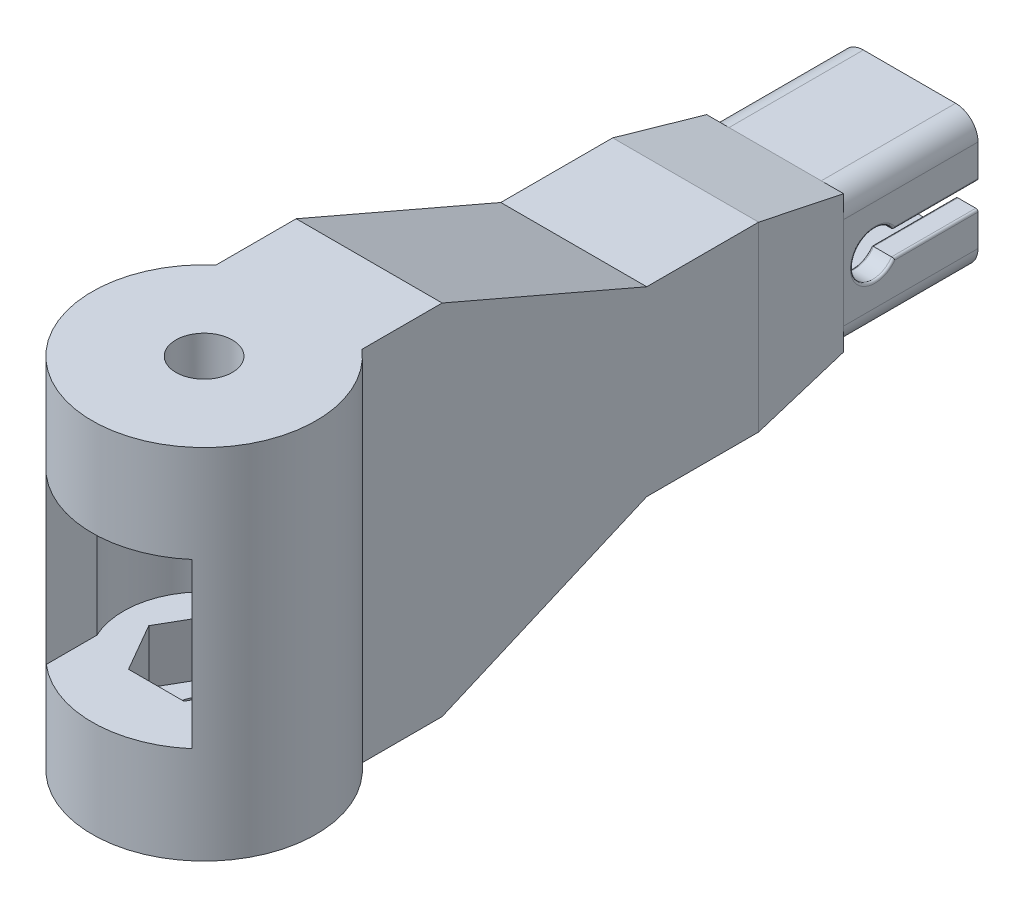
ISO-10303-21;
HEADER;
FILE_DESCRIPTION(('STEP AP214'),'2;1');
FILE_NAME('part.step','',(''),(''),'','','');
FILE_SCHEMA(('AUTOMOTIVE_DESIGN { 1 0 10303 214 1 1 1 1 }'));
ENDSEC;
DATA;
#1=APPLICATION_CONTEXT('core data for automotive mechanical design processes');
#2=APPLICATION_PROTOCOL_DEFINITION('international standard','automotive_design',2000,#1);
#3=PRODUCT_CONTEXT('',#1,'mechanical');
#4=PRODUCT('Part','Part','',(#3));
#5=PRODUCT_RELATED_PRODUCT_CATEGORY('part','',(#4));
#6=PRODUCT_DEFINITION_FORMATION('','',#4);
#7=PRODUCT_DEFINITION_CONTEXT('part definition',#1,'design');
#8=PRODUCT_DEFINITION('design','',#6,#7);
#9=PRODUCT_DEFINITION_SHAPE('','',#8);
#10=(LENGTH_UNIT() NAMED_UNIT(*) SI_UNIT(.MILLI.,.METRE.));
#11=(NAMED_UNIT(*) PLANE_ANGLE_UNIT() SI_UNIT($,.RADIAN.));
#12=(NAMED_UNIT(*) SI_UNIT($,.STERADIAN.) SOLID_ANGLE_UNIT());
#13=UNCERTAINTY_MEASURE_WITH_UNIT(LENGTH_MEASURE(1.E-05),#10,'distance_accuracy_value','');
#14=(GEOMETRIC_REPRESENTATION_CONTEXT(3) GLOBAL_UNCERTAINTY_ASSIGNED_CONTEXT((#13)) GLOBAL_UNIT_ASSIGNED_CONTEXT((#10,
#11,#12)) REPRESENTATION_CONTEXT('',''));
#15=CARTESIAN_POINT('',(0.,0.,0.));
#16=DIRECTION('',(0.,0.,1.));
#17=DIRECTION('',(1.,0.,0.));
#18=AXIS2_PLACEMENT_3D('',#15,#16,#17);
#19=CARTESIAN_POINT('',(5.15,5.15,63.));
#20=DIRECTION('',(-1.,0.,0.));
#21=DIRECTION('',(0.,-1.,0.));
#22=AXIS2_PLACEMENT_3D('',#19,#20,#21);
#23=PLANE('',#22);
#24=DIRECTION('',(0.,1.,0.));
#25=VECTOR('',#24,1.);
#26=CARTESIAN_POINT('',(5.15,5.15,69.663464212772));
#27=LINE('',#26,#25);
#28=CARTESIAN_POINT('',(5.15000000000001,-15.15,69.663464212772));
#29=VERTEX_POINT('',#28);
#30=CARTESIAN_POINT('',(5.15000000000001,-9.14999999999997,69.663464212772));
#31=VERTEX_POINT('',#30);
#32=EDGE_CURVE('E53',#29,#31,#27,.T.);
#33=ORIENTED_EDGE('',*,*,#32,.T.);
#34=DIRECTION('',(0.,0.,1.));
#35=VECTOR('',#34,1.);
#36=CARTESIAN_POINT('',(5.15000000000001,-9.14999999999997,63.));
#37=LINE('',#36,#35);
#38=CARTESIAN_POINT('',(5.15000000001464,-9.14999999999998,71.39261521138));
#39=VERTEX_POINT('',#38);
#40=EDGE_CURVE('E457',#31,#39,#37,.T.);
#41=ORIENTED_EDGE('',*,*,#40,.T.);
#42=DIRECTION('',(0.,1.,0.));
#43=VECTOR('',#42,1.);
#44=CARTESIAN_POINT('',(5.15000000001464,-41.9688308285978,71.39261521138));
#45=LINE('',#44,#43);
#46=CARTESIAN_POINT('',(5.15000000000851,9.15,71.3926152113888));
#47=VERTEX_POINT('',#46);
#48=EDGE_CURVE('E553',#39,#47,#45,.T.);
#49=ORIENTED_EDGE('',*,*,#48,.T.);
#50=DIRECTION('',(0.,0.,1.));
#51=VECTOR('',#50,1.);
#52=CARTESIAN_POINT('',(5.15,9.15,63.));
#53=LINE('',#52,#51);
#54=CARTESIAN_POINT('',(5.15,9.15,69.663464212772));
#55=VERTEX_POINT('',#54);
#56=EDGE_CURVE('E530',#55,#47,#53,.T.);
#57=ORIENTED_EDGE('',*,*,#56,.F.);
#58=DIRECTION('',(0.,-1.,0.));
#59=VECTOR('',#58,1.);
#60=CARTESIAN_POINT('',(5.15,5.15,69.663464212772));
#61=LINE('',#60,#59);
#62=CARTESIAN_POINT('',(5.15,15.15,69.663464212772));
#63=VERTEX_POINT('',#62);
#64=EDGE_CURVE('E535',#63,#55,#61,.T.);
#65=ORIENTED_EDGE('',*,*,#64,.F.);
#66=DIRECTION('',(0.,0.,-1.));
#67=VECTOR('',#66,1.);
#68=CARTESIAN_POINT('',(5.15,15.15,0.));
#69=LINE('',#68,#67);
#70=CARTESIAN_POINT('',(5.15,15.15,68.7735026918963));
#71=VERTEX_POINT('',#70);
#72=EDGE_CURVE('E611',#63,#71,#69,.T.);
#73=ORIENTED_EDGE('',*,*,#72,.T.);
#74=DIRECTION('',(0.,-0.866025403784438,-0.500000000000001));
#75=VECTOR('',#74,1.);
#76=CARTESIAN_POINT('',(5.15000000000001,-25.9923002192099,45.019984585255));
#77=LINE('',#76,#75);
#78=CARTESIAN_POINT('',(5.15,5.15,63.));
#79=VERTEX_POINT('',#78);
#80=EDGE_CURVE('E615',#71,#79,#77,.T.);
#81=ORIENTED_EDGE('',*,*,#80,.T.);
#82=DIRECTION('',(0.,0.,-1.));
#83=VECTOR('',#82,1.);
#84=CARTESIAN_POINT('',(5.15,5.15,63.));
#85=LINE('',#84,#83);
#86=CARTESIAN_POINT('',(5.15,5.15,0.));
#87=VERTEX_POINT('',#86);
#88=EDGE_CURVE('E685',#79,#87,#85,.T.);
#89=ORIENTED_EDGE('',*,*,#88,.T.);
#90=DIRECTION('',(0.,1.,0.));
#91=VECTOR('',#90,1.);
#92=CARTESIAN_POINT('',(5.15,5.15,0.));
#93=LINE('',#92,#91);
#94=CARTESIAN_POINT('',(5.15,1.625,0.));
#95=VERTEX_POINT('',#94);
#96=EDGE_CURVE('E677',#95,#87,#93,.T.);
#97=ORIENTED_EDGE('',*,*,#96,.F.);
#98=DIRECTION('',(0.,0.,-1.));
#99=VECTOR('',#98,1.);
#100=CARTESIAN_POINT('',(5.15,1.625,63.));
#101=LINE('',#100,#99);
#102=CARTESIAN_POINT('',(5.15,1.625,9.2814700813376));
#103=VERTEX_POINT('',#102);
#104=EDGE_CURVE('E717',#95,#103,#101,.F.);
#105=ORIENTED_EDGE('',*,*,#104,.T.);
#106=CARTESIAN_POINT('',(5.15,0.,11.5));
#107=DIRECTION('',(-1.,0.,0.));
#108=DIRECTION('',(0.,-1.,0.));
#109=AXIS2_PLACEMENT_3D('',#106,#107,#108);
#110=CIRCLE('',#109,2.75);
#111=CARTESIAN_POINT('',(5.15,-1.62499999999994,9.28147008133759));
#112=VERTEX_POINT('',#111);
#113=EDGE_CURVE('E719',#103,#112,#110,.F.);
#114=ORIENTED_EDGE('',*,*,#113,.T.);
#115=DIRECTION('',(0.,0.,-1.));
#116=VECTOR('',#115,1.);
#117=CARTESIAN_POINT('',(5.15,-1.625,0.));
#118=LINE('',#117,#116);
#119=CARTESIAN_POINT('',(5.15,-1.625,0.));
#120=VERTEX_POINT('',#119);
#121=EDGE_CURVE('E721',#112,#120,#118,.T.);
#122=ORIENTED_EDGE('',*,*,#121,.T.);
#123=CARTESIAN_POINT('',(5.15,-5.15,0.));
#124=VERTEX_POINT('',#123);
#125=EDGE_CURVE('E678',#124,#120,#93,.T.);
#126=ORIENTED_EDGE('',*,*,#125,.F.);
#127=DIRECTION('',(0.,0.,-1.));
#128=VECTOR('',#127,1.);
#129=CARTESIAN_POINT('',(5.15,-5.15,63.));
#130=LINE('',#129,#128);
#131=CARTESIAN_POINT('',(5.15,-5.15,63.));
#132=VERTEX_POINT('',#131);
#133=EDGE_CURVE('E688',#132,#124,#130,.T.);
#134=ORIENTED_EDGE('',*,*,#133,.F.);
#135=DIRECTION('',(0.,0.866025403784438,-0.500000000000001));
#136=VECTOR('',#135,1.);
#137=CARTESIAN_POINT('',(5.15,25.9923002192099,45.019984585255));
#138=LINE('',#137,#136);
#139=CARTESIAN_POINT('',(5.15,-15.15,68.7735026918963));
#140=VERTEX_POINT('',#139);
#141=EDGE_CURVE('E614',#140,#132,#138,.T.);
#142=ORIENTED_EDGE('',*,*,#141,.F.);
#143=DIRECTION('',(0.,0.,-1.));
#144=VECTOR('',#143,1.);
#145=CARTESIAN_POINT('',(5.15000000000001,-15.15,0.));
#146=LINE('',#145,#144);
#147=EDGE_CURVE('E612',#29,#140,#146,.T.);
#148=ORIENTED_EDGE('',*,*,#147,.F.);
#149=EDGE_LOOP('',(#33,#41,#49,#57,#65,#73,#81,#89,#97,#105,#114,#122,#126,#134,#142,#148));
#150=FACE_BOUND('',#149,.T.);
#151=ADVANCED_FACE('F37',(#150),#23,.T.);
#152=CARTESIAN_POINT('',(-5.15,5.15,63.));
#153=DIRECTION('',(1.,0.,0.));
#154=DIRECTION('',(0.,1.,0.));
#155=AXIS2_PLACEMENT_3D('',#152,#153,#154);
#156=PLANE('',#155);
#157=DIRECTION('',(0.,1.,0.));
#158=VECTOR('',#157,1.);
#159=CARTESIAN_POINT('',(-5.1500000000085,-41.9688308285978,71.3926152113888));
#160=LINE('',#159,#158);
#161=CARTESIAN_POINT('',(-5.1500000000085,-9.14999999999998,71.3926152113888));
#162=VERTEX_POINT('',#161);
#163=CARTESIAN_POINT('',(-5.1500000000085,9.15,71.3926152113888));
#164=VERTEX_POINT('',#163);
#165=EDGE_CURVE('E569',#162,#164,#160,.T.);
#166=ORIENTED_EDGE('',*,*,#165,.F.);
#167=DIRECTION('',(0.,0.,-1.));
#168=VECTOR('',#167,1.);
#169=CARTESIAN_POINT('',(-5.15,-9.14999999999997,63.));
#170=LINE('',#169,#168);
#171=CARTESIAN_POINT('',(-5.15,-9.14999999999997,69.663464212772));
#172=VERTEX_POINT('',#171);
#173=EDGE_CURVE('E61',#162,#172,#170,.T.);
#174=ORIENTED_EDGE('',*,*,#173,.T.);
#175=DIRECTION('',(0.,-1.,0.));
#176=VECTOR('',#175,1.);
#177=CARTESIAN_POINT('',(-5.15,5.15,69.663464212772));
#178=LINE('',#177,#176);
#179=CARTESIAN_POINT('',(-5.15,-15.15,69.663464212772));
#180=VERTEX_POINT('',#179);
#181=EDGE_CURVE('E459',#172,#180,#178,.T.);
#182=ORIENTED_EDGE('',*,*,#181,.T.);
#183=DIRECTION('',(0.,0.,-1.));
#184=VECTOR('',#183,1.);
#185=CARTESIAN_POINT('',(-5.15,-15.15,63.));
#186=LINE('',#185,#184);
#187=CARTESIAN_POINT('',(-5.15,-15.15,68.7735026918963));
#188=VERTEX_POINT('',#187);
#189=EDGE_CURVE('E604',#180,#188,#186,.T.);
#190=ORIENTED_EDGE('',*,*,#189,.T.);
#191=DIRECTION('',(0.,0.866025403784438,-0.500000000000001));
#192=VECTOR('',#191,1.);
#193=CARTESIAN_POINT('',(-5.15,6.32499999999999,56.374905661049));
#194=LINE('',#193,#192);
#195=CARTESIAN_POINT('',(-5.15,-5.14999999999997,63.));
#196=VERTEX_POINT('',#195);
#197=EDGE_CURVE('E606',#188,#196,#194,.T.);
#198=ORIENTED_EDGE('',*,*,#197,.T.);
#199=DIRECTION('',(0.,0.,-1.));
#200=VECTOR('',#199,1.);
#201=CARTESIAN_POINT('',(-5.15,-5.15,63.));
#202=LINE('',#201,#200);
#203=CARTESIAN_POINT('',(-5.15,-5.15,0.));
#204=VERTEX_POINT('',#203);
#205=EDGE_CURVE('E690',#196,#204,#202,.T.);
#206=ORIENTED_EDGE('',*,*,#205,.T.);
#207=DIRECTION('',(0.,-1.,0.));
#208=VECTOR('',#207,1.);
#209=CARTESIAN_POINT('',(-5.15,5.15,0.));
#210=LINE('',#209,#208);
#211=CARTESIAN_POINT('',(-5.15,5.15,0.));
#212=VERTEX_POINT('',#211);
#213=EDGE_CURVE('E653',#212,#204,#210,.T.);
#214=ORIENTED_EDGE('',*,*,#213,.F.);
#215=DIRECTION('',(0.,0.,-1.));
#216=VECTOR('',#215,1.);
#217=CARTESIAN_POINT('',(-5.15,5.15,63.));
#218=LINE('',#217,#216);
#219=CARTESIAN_POINT('',(-5.15,5.15,63.));
#220=VERTEX_POINT('',#219);
#221=EDGE_CURVE('E671',#220,#212,#218,.T.);
#222=ORIENTED_EDGE('',*,*,#221,.F.);
#223=DIRECTION('',(0.,-0.866025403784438,-0.500000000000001));
#224=VECTOR('',#223,1.);
#225=CARTESIAN_POINT('',(-5.15,8.9,65.1650635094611));
#226=LINE('',#225,#224);
#227=CARTESIAN_POINT('',(-5.15,15.15,68.7735026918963));
#228=VERTEX_POINT('',#227);
#229=EDGE_CURVE('E603',#228,#220,#226,.T.);
#230=ORIENTED_EDGE('',*,*,#229,.F.);
#231=DIRECTION('',(0.,0.,-1.));
#232=VECTOR('',#231,1.);
#233=CARTESIAN_POINT('',(-5.15,15.15,63.));
#234=LINE('',#233,#232);
#235=CARTESIAN_POINT('',(-5.15,15.15,69.663464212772));
#236=VERTEX_POINT('',#235);
#237=EDGE_CURVE('E607',#236,#228,#234,.T.);
#238=ORIENTED_EDGE('',*,*,#237,.F.);
#239=DIRECTION('',(0.,1.,0.));
#240=VECTOR('',#239,1.);
#241=CARTESIAN_POINT('',(-5.15,5.15,69.663464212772));
#242=LINE('',#241,#240);
#243=CARTESIAN_POINT('',(-5.15,9.15,69.663464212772));
#244=VERTEX_POINT('',#243);
#245=EDGE_CURVE('E533',#244,#236,#242,.T.);
#246=ORIENTED_EDGE('',*,*,#245,.F.);
#247=DIRECTION('',(0.,0.,-1.));
#248=VECTOR('',#247,1.);
#249=CARTESIAN_POINT('',(-5.15,9.15,63.));
#250=LINE('',#249,#248);
#251=EDGE_CURVE('E522',#164,#244,#250,.T.);
#252=ORIENTED_EDGE('',*,*,#251,.F.);
#253=EDGE_LOOP('',(#166,#174,#182,#190,#198,#206,#214,#222,#230,#238,#246,#252));
#254=FACE_BOUND('',#253,.T.);
#255=ADVANCED_FACE('F843',(#254),#156,.T.);
#256=CARTESIAN_POINT('',(-37.970688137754,-15.15,0.));
#257=DIRECTION('',(0.,-1.,0.));
#258=DIRECTION('',(0.,0.,-1.));
#259=AXIS2_PLACEMENT_3D('',#256,#257,#258);
#260=PLANE('',#259);
#261=DIRECTION('',(-1.,0.,0.));
#262=VECTOR('',#261,1.);
#263=CARTESIAN_POINT('',(-37.970688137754,-15.15,69.663464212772));
#264=LINE('',#263,#262);
#265=EDGE_CURVE('E400',#29,#180,#264,.T.);
#266=ORIENTED_EDGE('',*,*,#265,.F.);
#267=ORIENTED_EDGE('',*,*,#147,.T.);
#268=DIRECTION('',(1.,0.,0.));
#269=VECTOR('',#268,1.);
#270=CARTESIAN_POINT('',(-37.970688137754,-15.15,68.7735026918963));
#271=LINE('',#270,#269);
#272=EDGE_CURVE('E620',#188,#140,#271,.T.);
#273=ORIENTED_EDGE('',*,*,#272,.F.);
#274=ORIENTED_EDGE('',*,*,#189,.F.);
#275=EDGE_LOOP('',(#266,#267,#273,#274));
#276=FACE_BOUND('',#275,.T.);
#277=ADVANCED_FACE('F848',(#276),#260,.F.);
#278=CARTESIAN_POINT('',(0.,-41.9688308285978,78.7735026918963));
#279=DIRECTION('',(0.,1.,0.));
#280=DIRECTION('',(0.,0.,1.));
#281=AXIS2_PLACEMENT_3D('',#278,#279,#280);
#282=CYLINDRICAL_SURFACE('',#281,8.99999999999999);
#283=CARTESIAN_POINT('',(0.,-9.14999999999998,78.7735026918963));
#284=DIRECTION('',(0.,-1.,0.));
#285=DIRECTION('',(0.,0.,-1.));
#286=AXIS2_PLACEMENT_3D('',#283,#284,#285);
#287=CIRCLE('',#286,8.99999999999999);
#288=CARTESIAN_POINT('',(8.15000000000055,-9.14999999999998,82.591551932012));
#289=VERTEX_POINT('',#288);
#290=EDGE_CURVE('E454',#289,#39,#287,.F.);
#291=ORIENTED_EDGE('',*,*,#290,.F.);
#292=DIRECTION('',(0.,1.,0.));
#293=VECTOR('',#292,1.);
#294=CARTESIAN_POINT('',(8.15000000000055,-41.9688308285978,82.591551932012));
#295=LINE('',#294,#293);
#296=CARTESIAN_POINT('',(8.15000000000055,9.15,82.591551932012));
#297=VERTEX_POINT('',#296);
#298=EDGE_CURVE('E561',#289,#297,#295,.T.);
#299=ORIENTED_EDGE('',*,*,#298,.T.);
#300=CARTESIAN_POINT('',(0.,9.15,78.7735026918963));
#301=DIRECTION('',(0.,-1.,0.));
#302=DIRECTION('',(1.,0.,0.));
#303=AXIS2_PLACEMENT_3D('',#300,#301,#302);
#304=CIRCLE('',#303,8.99999999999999);
#305=EDGE_CURVE('E527',#297,#47,#304,.F.);
#306=ORIENTED_EDGE('',*,*,#305,.T.);
#307=ORIENTED_EDGE('',*,*,#48,.F.);
#308=EDGE_LOOP('',(#291,#299,#306,#307));
#309=FACE_BOUND('',#308,.T.);
#310=ADVANCED_FACE('F963',(#309),#282,.F.);
#311=CARTESIAN_POINT('',(8.15000000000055,-41.9688308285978,291595.436324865));
#312=DIRECTION('',(1.,0.,0.));
#313=DIRECTION('',(0.,0.,-1.));
#314=AXIS2_PLACEMENT_3D('',#311,#312,#313);
#315=PLANE('',#314);
#316=DIRECTION('',(0.,0.,-1.));
#317=VECTOR('',#316,1.);
#318=CARTESIAN_POINT('',(8.15000000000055,-9.15000000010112,291595.436324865));
#319=LINE('',#318,#317);
#320=CARTESIAN_POINT('',(8.15000000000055,-9.14999999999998,88.2512397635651));
#321=VERTEX_POINT('',#320);
#322=EDGE_CURVE('E451',#321,#289,#319,.T.);
#323=ORIENTED_EDGE('',*,*,#322,.F.);
#324=DIRECTION('',(0.,1.,0.));
#325=VECTOR('',#324,1.);
#326=CARTESIAN_POINT('',(8.15000000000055,-41.9688308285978,88.2512397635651));
#327=LINE('',#326,#325);
#328=CARTESIAN_POINT('',(8.15000000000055,9.15,88.2512397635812));
#329=VERTEX_POINT('',#328);
#330=EDGE_CURVE('E563',#321,#329,#327,.T.);
#331=ORIENTED_EDGE('',*,*,#330,.T.);
#332=DIRECTION('',(0.,0.,-1.));
#333=VECTOR('',#332,1.);
#334=CARTESIAN_POINT('',(8.15000000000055,9.15,291595.436324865));
#335=LINE('',#334,#333);
#336=EDGE_CURVE('E524',#329,#297,#335,.T.);
#337=ORIENTED_EDGE('',*,*,#336,.T.);
#338=ORIENTED_EDGE('',*,*,#298,.F.);
#339=EDGE_LOOP('',(#323,#331,#337,#338));
#340=FACE_BOUND('',#339,.T.);
#341=ADVANCED_FACE('F966',(#340),#315,.F.);
#342=CARTESIAN_POINT('',(-8.15000000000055,-41.9688308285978,291595.436324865));
#343=DIRECTION('',(-1.,0.,0.));
#344=DIRECTION('',(0.,0.,1.));
#345=AXIS2_PLACEMENT_3D('',#342,#343,#344);
#346=PLANE('',#345);
#347=DIRECTION('',(0.,0.,1.));
#348=VECTOR('',#347,1.);
#349=CARTESIAN_POINT('',(-8.15000000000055,-9.15000000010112,291595.436324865));
#350=LINE('',#349,#348);
#351=CARTESIAN_POINT('',(-8.1500000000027,-9.14999999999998,82.591551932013));
#352=VERTEX_POINT('',#351);
#353=CARTESIAN_POINT('',(-8.14999999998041,-9.14999999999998,88.2512397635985));
#354=VERTEX_POINT('',#353);
#355=EDGE_CURVE('E445',#352,#354,#350,.T.);
#356=ORIENTED_EDGE('',*,*,#355,.F.);
#357=DIRECTION('',(0.,1.,0.));
#358=VECTOR('',#357,1.);
#359=CARTESIAN_POINT('',(-8.15000000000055,-41.9688308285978,82.591551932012));
#360=LINE('',#359,#358);
#361=CARTESIAN_POINT('',(-8.15000000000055,9.15,82.591551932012));
#362=VERTEX_POINT('',#361);
#363=EDGE_CURVE('E567',#352,#362,#360,.T.);
#364=ORIENTED_EDGE('',*,*,#363,.T.);
#365=DIRECTION('',(0.,0.,1.));
#366=VECTOR('',#365,1.);
#367=CARTESIAN_POINT('',(-8.15000000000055,9.15,291595.436324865));
#368=LINE('',#367,#366);
#369=CARTESIAN_POINT('',(-8.15000000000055,9.15,88.2512397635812));
#370=VERTEX_POINT('',#369);
#371=EDGE_CURVE('E517',#362,#370,#368,.T.);
#372=ORIENTED_EDGE('',*,*,#371,.T.);
#373=DIRECTION('',(0.,1.,0.));
#374=VECTOR('',#373,1.);
#375=CARTESIAN_POINT('',(-8.14999999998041,-41.9688308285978,88.2512397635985));
#376=LINE('',#375,#374);
#377=EDGE_CURVE('E565',#354,#370,#376,.T.);
#378=ORIENTED_EDGE('',*,*,#377,.F.);
#379=EDGE_LOOP('',(#356,#364,#372,#378));
#380=FACE_BOUND('',#379,.T.);
#381=ADVANCED_FACE('F974',(#380),#346,.F.);
#382=CARTESIAN_POINT('',(0.,-41.9688308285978,78.7735026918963));
#383=DIRECTION('',(0.,1.,0.));
#384=DIRECTION('',(0.,0.,1.));
#385=AXIS2_PLACEMENT_3D('',#382,#383,#384);
#386=CYLINDRICAL_SURFACE('',#385,8.99999999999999);
#387=CARTESIAN_POINT('',(0.,-9.14999999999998,78.7735026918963));
#388=DIRECTION('',(0.,-1.,0.));
#389=DIRECTION('',(0.,0.,-1.));
#390=AXIS2_PLACEMENT_3D('',#387,#388,#389);
#391=CIRCLE('',#390,8.99999999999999);
#392=EDGE_CURVE('E11',#162,#352,#391,.F.);
#393=ORIENTED_EDGE('',*,*,#392,.F.);
#394=ORIENTED_EDGE('',*,*,#165,.T.);
#395=CARTESIAN_POINT('',(0.,9.15,78.7735026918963));
#396=DIRECTION('',(0.,-1.,0.));
#397=DIRECTION('',(1.,0.,0.));
#398=AXIS2_PLACEMENT_3D('',#395,#396,#397);
#399=CIRCLE('',#398,8.99999999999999);
#400=EDGE_CURVE('E46',#164,#362,#399,.F.);
#401=ORIENTED_EDGE('',*,*,#400,.T.);
#402=ORIENTED_EDGE('',*,*,#363,.F.);
#403=EDGE_LOOP('',(#393,#394,#401,#402));
#404=FACE_BOUND('',#403,.T.);
#405=ADVANCED_FACE('F940',(#404),#386,.F.);
#406=CARTESIAN_POINT('',(-37.970688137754,15.15,0.));
#407=DIRECTION('',(0.,-1.,0.));
#408=DIRECTION('',(1.,0.,0.));
#409=AXIS2_PLACEMENT_3D('',#406,#407,#408);
#410=PLANE('',#409);
#411=CARTESIAN_POINT('',(0.,15.15,78.7735026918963));
#412=DIRECTION('',(0.,-1.,0.));
#413=DIRECTION('',(1.,0.,0.));
#414=AXIS2_PLACEMENT_3D('',#411,#412,#413);
#415=CIRCLE('',#414,3.15);
#416=CARTESIAN_POINT('',(3.15000000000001,15.15,78.7735026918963));
#417=VERTEX_POINT('',#416);
#418=EDGE_CURVE('E600',#417,#417,#415,.T.);
#419=ORIENTED_EDGE('',*,*,#418,.F.);
#420=EDGE_LOOP('',(#419));
#421=FACE_BOUND('',#420,.T.);
#422=DIRECTION('',(1.,0.,0.));
#423=VECTOR('',#422,1.);
#424=CARTESIAN_POINT('',(-37.970688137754,15.15,84.1235026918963));
#425=LINE('',#424,#423);
#426=CARTESIAN_POINT('',(-3.08882394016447,15.15,84.1235026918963));
#427=VERTEX_POINT('',#426);
#428=CARTESIAN_POINT('',(3.08882394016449,15.15,84.1235026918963));
#429=VERTEX_POINT('',#428);
#430=EDGE_CURVE('E485',#427,#429,#425,.T.);
#431=ORIENTED_EDGE('',*,*,#430,.F.);
#432=DIRECTION('',(0.5,0.,0.866025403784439));
#433=VECTOR('',#432,1.);
#434=CARTESIAN_POINT('',(-48.2358351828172,15.15,5.92658540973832));
#435=LINE('',#434,#433);
#436=CARTESIAN_POINT('',(-6.17764788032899,15.15,78.7735026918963));
#437=VERTEX_POINT('',#436);
#438=EDGE_CURVE('E462',#437,#427,#435,.T.);
#439=ORIENTED_EDGE('',*,*,#438,.F.);
#440=DIRECTION('',(-0.5,0.,0.866025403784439));
#441=VECTOR('',#440,1.);
#442=CARTESIAN_POINT('',(19.9840192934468,15.15,33.4601659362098));
#443=LINE('',#442,#441);
#444=CARTESIAN_POINT('',(-3.08882394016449,15.15,73.4235026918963));
#445=VERTEX_POINT('',#444);
#446=EDGE_CURVE('E467',#445,#437,#443,.T.);
#447=ORIENTED_EDGE('',*,*,#446,.F.);
#448=DIRECTION('',(-1.,0.,0.));
#449=VECTOR('',#448,1.);
#450=CARTESIAN_POINT('',(-37.970688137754,15.15,73.4235026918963));
#451=LINE('',#450,#449);
#452=CARTESIAN_POINT('',(3.08882394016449,15.15,73.4235026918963));
#453=VERTEX_POINT('',#452);
#454=EDGE_CURVE('E494',#453,#445,#451,.T.);
#455=ORIENTED_EDGE('',*,*,#454,.F.);
#456=DIRECTION('',(-0.5,0.,-0.866025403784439));
#457=VECTOR('',#456,1.);
#458=CARTESIAN_POINT('',(-38.9693633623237,15.15,0.576585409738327));
#459=LINE('',#458,#457);
#460=CARTESIAN_POINT('',(6.17764788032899,15.15,78.7735026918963));
#461=VERTEX_POINT('',#460);
#462=EDGE_CURVE('E491',#461,#453,#459,.T.);
#463=ORIENTED_EDGE('',*,*,#462,.F.);
#464=DIRECTION('',(0.5,0.,-0.866025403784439));
#465=VECTOR('',#464,1.);
#466=CARTESIAN_POINT('',(29.2504911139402,15.15,38.8101659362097));
#467=LINE('',#466,#465);
#468=EDGE_CURVE('E488',#429,#461,#467,.T.);
#469=ORIENTED_EDGE('',*,*,#468,.F.);
#470=EDGE_LOOP('',(#431,#439,#447,#455,#463,#469));
#471=FACE_BOUND('',#470,.T.);
#472=ADVANCED_FACE('F868',(#421,#471),#410,.T.);
#473=CARTESIAN_POINT('',(-8.15,10.15,63.));
#474=DIRECTION('',(0.,-1.,0.));
#475=DIRECTION('',(0.,0.,-1.));
#476=AXIS2_PLACEMENT_3D('',#473,#474,#475);
#477=PLANE('',#476);
#478=DIRECTION('',(1.,0.,0.));
#479=VECTOR('',#478,1.);
#480=CARTESIAN_POINT('',(-40.8617947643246,10.15,37.4933268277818));
#481=LINE('',#480,#479);
#482=CARTESIAN_POINT('',(-8.15,10.15,37.4933268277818));
#483=VERTEX_POINT('',#482);
#484=CARTESIAN_POINT('',(8.15,10.15,37.4933268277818));
#485=VERTEX_POINT('',#484);
#486=EDGE_CURVE('E554',#483,#485,#481,.T.);
#487=ORIENTED_EDGE('',*,*,#486,.T.);
#488=DIRECTION('',(0.,0.,-1.));
#489=VECTOR('',#488,1.);
#490=CARTESIAN_POINT('',(8.15,10.15,63.));
#491=LINE('',#490,#489);
#492=CARTESIAN_POINT('',(8.15,10.15,25.0000000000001));
#493=VERTEX_POINT('',#492);
#494=EDGE_CURVE('E695',#485,#493,#491,.T.);
#495=ORIENTED_EDGE('',*,*,#494,.T.);
#496=DIRECTION('',(-1.,0.,0.));
#497=VECTOR('',#496,1.);
#498=CARTESIAN_POINT('',(-8.15,10.15,25.0000000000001));
#499=LINE('',#498,#497);
#500=CARTESIAN_POINT('',(-8.15,10.15,25.0000000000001));
#501=VERTEX_POINT('',#500);
#502=EDGE_CURVE('E714',#493,#501,#499,.T.);
#503=ORIENTED_EDGE('',*,*,#502,.T.);
#504=DIRECTION('',(0.,0.,-1.));
#505=VECTOR('',#504,1.);
#506=CARTESIAN_POINT('',(-8.15,10.15,63.));
#507=LINE('',#506,#505);
#508=EDGE_CURVE('E693',#483,#501,#507,.T.);
#509=ORIENTED_EDGE('',*,*,#508,.F.);
#510=EDGE_LOOP('',(#487,#495,#503,#509));
#511=FACE_BOUND('',#510,.T.);
#512=ADVANCED_FACE('F864',(#511),#477,.F.);
#513=CARTESIAN_POINT('',(0.,20.,0.));
#514=DIRECTION('',(0.,1.,0.));
#515=DIRECTION('',(0.,0.,1.));
#516=AXIS2_PLACEMENT_3D('',#513,#514,#515);
#517=PLANE('',#516);
#518=CARTESIAN_POINT('',(0.,20.,78.7735026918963));
#519=DIRECTION('',(0.,1.,0.));
#520=DIRECTION('',(-1.,0.,0.));
#521=AXIS2_PLACEMENT_3D('',#518,#519,#520);
#522=CIRCLE('',#521,3.15);
#523=CARTESIAN_POINT('',(-3.15,20.,78.7735026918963));
#524=VERTEX_POINT('',#523);
#525=EDGE_CURVE('E589',#524,#524,#522,.T.);
#526=ORIENTED_EDGE('',*,*,#525,.F.);
#527=EDGE_LOOP('',(#526));
#528=FACE_BOUND('',#527,.T.);
#529=DIRECTION('',(0.,0.,1.));
#530=VECTOR('',#529,1.);
#531=CARTESIAN_POINT('',(-8.15,20.,58.7735026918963));
#532=LINE('',#531,#530);
#533=CARTESIAN_POINT('',(-8.15,20.,60.3402627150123));
#534=VERTEX_POINT('',#533);
#535=CARTESIAN_POINT('',(-8.15,20.,69.2957656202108));
#536=VERTEX_POINT('',#535);
#537=EDGE_CURVE('E592',#534,#536,#532,.T.);
#538=ORIENTED_EDGE('',*,*,#537,.T.);
#539=CARTESIAN_POINT('',(0.,20.,78.7735026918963));
#540=DIRECTION('',(0.,1.,0.));
#541=DIRECTION('',(0.,0.,1.));
#542=AXIS2_PLACEMENT_3D('',#539,#540,#541);
#543=CIRCLE('',#542,12.5);
#544=CARTESIAN_POINT('',(8.15,20.,69.2957656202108));
#545=VERTEX_POINT('',#544);
#546=EDGE_CURVE('E576',#536,#545,#543,.T.);
#547=ORIENTED_EDGE('',*,*,#546,.T.);
#548=DIRECTION('',(0.,0.,-1.));
#549=VECTOR('',#548,1.);
#550=CARTESIAN_POINT('',(8.15,20.,88.7735026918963));
#551=LINE('',#550,#549);
#552=CARTESIAN_POINT('',(8.15,20.,60.3402627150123));
#553=VERTEX_POINT('',#552);
#554=EDGE_CURVE('E595',#545,#553,#551,.T.);
#555=ORIENTED_EDGE('',*,*,#554,.T.);
#556=DIRECTION('',(1.,0.,0.));
#557=VECTOR('',#556,1.);
#558=CARTESIAN_POINT('',(-40.8617947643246,20.,60.3402627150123));
#559=LINE('',#558,#557);
#560=EDGE_CURVE('E556',#534,#553,#559,.T.);
#561=ORIENTED_EDGE('',*,*,#560,.F.);
#562=EDGE_LOOP('',(#538,#547,#555,#561));
#563=FACE_BOUND('',#562,.T.);
#564=ADVANCED_FACE('F867',(#528,#563),#517,.T.);
#565=CARTESIAN_POINT('',(0.,-20.,0.));
#566=DIRECTION('',(0.,1.,0.));
#567=DIRECTION('',(0.,0.,1.));
#568=AXIS2_PLACEMENT_3D('',#565,#566,#567);
#569=PLANE('',#568);
#570=CARTESIAN_POINT('',(0.,-20.,78.7735026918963));
#571=DIRECTION('',(0.,1.,0.));
#572=DIRECTION('',(0.,0.,1.));
#573=AXIS2_PLACEMENT_3D('',#570,#571,#572);
#574=CIRCLE('',#573,3.15);
#575=CARTESIAN_POINT('',(0.,-20.,81.9235026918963));
#576=VERTEX_POINT('',#575);
#577=EDGE_CURVE('E581',#576,#576,#574,.T.);
#578=ORIENTED_EDGE('',*,*,#577,.T.);
#579=EDGE_LOOP('',(#578));
#580=FACE_BOUND('',#579,.T.);
#581=CARTESIAN_POINT('',(0.,-20.,78.7735026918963));
#582=DIRECTION('',(0.,1.,0.));
#583=DIRECTION('',(0.,0.,1.));
#584=AXIS2_PLACEMENT_3D('',#581,#582,#583);
#585=CIRCLE('',#584,12.5);
#586=CARTESIAN_POINT('',(8.15,-20.,69.2957656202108));
#587=VERTEX_POINT('',#586);
#588=CARTESIAN_POINT('',(-8.15,-20.,69.2957656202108));
#589=VERTEX_POINT('',#588);
#590=EDGE_CURVE('E579',#587,#589,#585,.F.);
#591=ORIENTED_EDGE('',*,*,#590,.T.);
#592=DIRECTION('',(0.,0.,1.));
#593=VECTOR('',#592,1.);
#594=CARTESIAN_POINT('',(-8.15,-20.,0.));
#595=LINE('',#594,#593);
#596=CARTESIAN_POINT('',(-8.15,-20.,60.3402627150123));
#597=VERTEX_POINT('',#596);
#598=EDGE_CURVE('E584',#597,#589,#595,.T.);
#599=ORIENTED_EDGE('',*,*,#598,.F.);
#600=DIRECTION('',(1.,0.,0.));
#601=VECTOR('',#600,1.);
#602=CARTESIAN_POINT('',(-40.8617947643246,-20.,60.3402627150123));
#603=LINE('',#602,#601);
#604=CARTESIAN_POINT('',(8.15000000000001,-20.,60.3402627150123));
#605=VERTEX_POINT('',#604);
#606=EDGE_CURVE('E540',#597,#605,#603,.T.);
#607=ORIENTED_EDGE('',*,*,#606,.T.);
#608=DIRECTION('',(0.,0.,-1.));
#609=VECTOR('',#608,1.);
#610=CARTESIAN_POINT('',(8.15,-20.,0.));
#611=LINE('',#610,#609);
#612=EDGE_CURVE('E587',#587,#605,#611,.T.);
#613=ORIENTED_EDGE('',*,*,#612,.F.);
#614=EDGE_LOOP('',(#591,#599,#607,#613));
#615=FACE_BOUND('',#614,.T.);
#616=ADVANCED_FACE('F883',(#580,#615),#569,.F.);
#617=CARTESIAN_POINT('',(-8.15,10.15,63.));
#618=DIRECTION('',(1.,0.,0.));
#619=DIRECTION('',(0.,1.,0.));
#620=AXIS2_PLACEMENT_3D('',#617,#618,#619);
#621=PLANE('',#620);
#622=DIRECTION('',(0.,0.,-1.));
#623=VECTOR('',#622,1.);
#624=CARTESIAN_POINT('',(-8.15,-10.15,63.));
#625=LINE('',#624,#623);
#626=CARTESIAN_POINT('',(-8.15,-10.15,37.4933268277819));
#627=VERTEX_POINT('',#626);
#628=CARTESIAN_POINT('',(-8.15,-10.15,25.0000000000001));
#629=VERTEX_POINT('',#628);
#630=EDGE_CURVE('E699',#627,#629,#625,.T.);
#631=ORIENTED_EDGE('',*,*,#630,.F.);
#632=DIRECTION('',(0.,-0.395903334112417,0.918292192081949));
#633=VECTOR('',#632,1.);
#634=CARTESIAN_POINT('',(-8.15,5.0717896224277,2.18660077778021));
#635=LINE('',#634,#633);
#636=EDGE_CURVE('E544',#627,#597,#635,.T.);
#637=ORIENTED_EDGE('',*,*,#636,.T.);
#638=ORIENTED_EDGE('',*,*,#598,.T.);
#639=DIRECTION('',(0.,1.,0.));
#640=VECTOR('',#639,1.);
#641=CARTESIAN_POINT('',(-8.15,-39.4482004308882,69.2957656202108));
#642=LINE('',#641,#640);
#643=EDGE_CURVE('E574',#589,#536,#642,.T.);
#644=ORIENTED_EDGE('',*,*,#643,.T.);
#645=ORIENTED_EDGE('',*,*,#537,.F.);
#646=DIRECTION('',(0.,0.395903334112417,0.918292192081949));
#647=VECTOR('',#646,1.);
#648=CARTESIAN_POINT('',(-8.15,-5.07178962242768,2.1866007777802));
#649=LINE('',#648,#647);
#650=EDGE_CURVE('E550',#483,#534,#649,.T.);
#651=ORIENTED_EDGE('',*,*,#650,.F.);
#652=ORIENTED_EDGE('',*,*,#508,.T.);
#653=DIRECTION('',(0.,-1.,0.));
#654=VECTOR('',#653,1.);
#655=CARTESIAN_POINT('',(-8.15,-7.65,25.0000000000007));
#656=LINE('',#655,#654);
#657=EDGE_CURVE('E917',#501,#629,#656,.T.);
#658=ORIENTED_EDGE('',*,*,#657,.T.);
#659=EDGE_LOOP('',(#631,#637,#638,#644,#645,#651,#652,#658));
#660=FACE_BOUND('',#659,.T.);
#661=ADVANCED_FACE('F879',(#660),#621,.F.);
#662=CARTESIAN_POINT('',(0.,0.,15.));
#663=DIRECTION('',(0.,0.,-1.));
#664=DIRECTION('',(-1.,0.,0.));
#665=AXIS2_PLACEMENT_3D('',#662,#663,#664);
#666=PLANE('',#665);
#667=DIRECTION('',(1.,0.,0.));
#668=VECTOR('',#667,1.);
#669=CARTESIAN_POINT('',(8.15,7.65,15.));
#670=LINE('',#669,#668);
#671=CARTESIAN_POINT('',(5.15,7.65,15.));
#672=VERTEX_POINT('',#671);
#673=CARTESIAN_POINT('',(7.65,7.65,15.));
#674=VERTEX_POINT('',#673);
#675=EDGE_CURVE('E701',#672,#674,#670,.T.);
#676=ORIENTED_EDGE('',*,*,#675,.T.);
#677=DIRECTION('',(0.,-1.,0.));
#678=VECTOR('',#677,1.);
#679=CARTESIAN_POINT('',(7.65000000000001,-7.65,15.));
#680=LINE('',#679,#678);
#681=CARTESIAN_POINT('',(7.65,5.15,15.));
#682=VERTEX_POINT('',#681);
#683=EDGE_CURVE('E932',#674,#682,#680,.T.);
#684=ORIENTED_EDGE('',*,*,#683,.T.);
#685=CARTESIAN_POINT('',(5.15,5.15,15.));
#686=DIRECTION('',(0.,0.,-1.));
#687=DIRECTION('',(-1.,0.,0.));
#688=AXIS2_PLACEMENT_3D('',#685,#686,#687);
#689=CIRCLE('',#688,2.5);
#690=EDGE_CURVE('E1051',#682,#672,#689,.F.);
#691=ORIENTED_EDGE('',*,*,#690,.T.);
#692=EDGE_LOOP('',(#676,#684,#691));
#693=FACE_BOUND('',#692,.T.);
#694=ADVANCED_FACE('F882',(#693),#666,.T.);
#695=DIRECTION('',(-1.,0.,0.));
#696=VECTOR('',#695,1.);
#697=CARTESIAN_POINT('',(-8.15,-7.65,15.));
#698=LINE('',#697,#696);
#699=CARTESIAN_POINT('',(-5.15,-7.65,15.));
#700=VERTEX_POINT('',#699);
#701=CARTESIAN_POINT('',(-7.65,-7.65,15.));
#702=VERTEX_POINT('',#701);
#703=EDGE_CURVE('E706',#700,#702,#698,.T.);
#704=ORIENTED_EDGE('',*,*,#703,.T.);
#705=DIRECTION('',(0.,1.,0.));
#706=VECTOR('',#705,1.);
#707=CARTESIAN_POINT('',(-7.65,7.65,15.));
#708=LINE('',#707,#706);
#709=CARTESIAN_POINT('',(-7.65,-5.15,15.));
#710=VERTEX_POINT('',#709);
#711=EDGE_CURVE('E922',#702,#710,#708,.T.);
#712=ORIENTED_EDGE('',*,*,#711,.T.);
#713=CARTESIAN_POINT('',(-5.15,-5.15,15.));
#714=DIRECTION('',(0.,0.,-1.));
#715=DIRECTION('',(-1.,0.,0.));
#716=AXIS2_PLACEMENT_3D('',#713,#714,#715);
#717=CIRCLE('',#716,2.5);
#718=EDGE_CURVE('E1040',#710,#700,#717,.F.);
#719=ORIENTED_EDGE('',*,*,#718,.T.);
#720=EDGE_LOOP('',(#704,#712,#719));
#721=FACE_BOUND('',#720,.T.);
#722=ADVANCED_FACE('F873',(#721),#666,.T.);
#723=CARTESIAN_POINT('',(8.15,10.15,63.));
#724=DIRECTION('',(-1.,0.,0.));
#725=DIRECTION('',(0.,-1.,0.));
#726=AXIS2_PLACEMENT_3D('',#723,#724,#725);
#727=PLANE('',#726);
#728=DIRECTION('',(0.,0.395903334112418,-0.918292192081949));
#729=VECTOR('',#728,1.);
#730=CARTESIAN_POINT('',(8.15,5.0717896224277,2.18660077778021));
#731=LINE('',#730,#729);
#732=CARTESIAN_POINT('',(8.15000000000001,-10.15,37.4933268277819));
#733=VERTEX_POINT('',#732);
#734=EDGE_CURVE('E537',#605,#733,#731,.T.);
#735=ORIENTED_EDGE('',*,*,#734,.T.);
#736=DIRECTION('',(0.,0.,-1.));
#737=VECTOR('',#736,1.);
#738=CARTESIAN_POINT('',(8.15000000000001,-10.15,63.));
#739=LINE('',#738,#737);
#740=CARTESIAN_POINT('',(8.15000000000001,-10.15,25.0000000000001));
#741=VERTEX_POINT('',#740);
#742=EDGE_CURVE('E697',#733,#741,#739,.T.);
#743=ORIENTED_EDGE('',*,*,#742,.T.);
#744=DIRECTION('',(0.,1.,0.));
#745=VECTOR('',#744,1.);
#746=CARTESIAN_POINT('',(8.15,7.65,25.0000000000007));
#747=LINE('',#746,#745);
#748=EDGE_CURVE('E935',#741,#493,#747,.T.);
#749=ORIENTED_EDGE('',*,*,#748,.T.);
#750=ORIENTED_EDGE('',*,*,#494,.F.);
#751=DIRECTION('',(0.,-0.395903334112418,-0.918292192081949));
#752=VECTOR('',#751,1.);
#753=CARTESIAN_POINT('',(8.15000000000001,-5.07178962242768,2.1866007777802));
#754=LINE('',#753,#752);
#755=EDGE_CURVE('E549',#553,#485,#754,.T.);
#756=ORIENTED_EDGE('',*,*,#755,.F.);
#757=ORIENTED_EDGE('',*,*,#554,.F.);
#758=DIRECTION('',(0.,1.,0.));
#759=VECTOR('',#758,1.);
#760=CARTESIAN_POINT('',(8.15,-39.4482004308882,69.2957656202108));
#761=LINE('',#760,#759);
#762=EDGE_CURVE('E571',#587,#545,#761,.T.);
#763=ORIENTED_EDGE('',*,*,#762,.F.);
#764=ORIENTED_EDGE('',*,*,#612,.T.);
#765=EDGE_LOOP('',(#735,#743,#749,#750,#756,#757,#763,#764));
#766=FACE_BOUND('',#765,.T.);
#767=ADVANCED_FACE('F870',(#766),#727,.F.);
#768=CARTESIAN_POINT('',(0.,-20.15,78.7735026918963));
#769=DIRECTION('',(0.,1.,0.));
#770=DIRECTION('',(0.,0.,1.));
#771=AXIS2_PLACEMENT_3D('',#768,#769,#770);
#772=CYLINDRICAL_SURFACE('',#771,3.15);
#773=ORIENTED_EDGE('',*,*,#418,.T.);
#774=EDGE_LOOP('',(#773));
#775=FACE_BOUND('',#774,.T.);
#776=ORIENTED_EDGE('',*,*,#525,.T.);
#777=EDGE_LOOP('',(#776));
#778=FACE_BOUND('',#777,.T.);
#779=ADVANCED_FACE('F840',(#775,#778),#772,.F.);
#780=CARTESIAN_POINT('',(0.,0.,0.));
#781=DIRECTION('',(0.,0.,1.));
#782=DIRECTION('',(1.,0.,0.));
#783=AXIS2_PLACEMENT_3D('',#780,#781,#782);
#784=PLANE('',#783);
#785=DIRECTION('',(-1.,0.,0.));
#786=VECTOR('',#785,1.);
#787=CARTESIAN_POINT('',(0.,-7.65,0.));
#788=LINE('',#787,#786);
#789=CARTESIAN_POINT('',(5.15,-7.65,0.));
#790=VERTEX_POINT('',#789);
#791=CARTESIAN_POINT('',(-5.15,-7.65,0.));
#792=VERTEX_POINT('',#791);
#793=EDGE_CURVE('E659',#790,#792,#788,.T.);
#794=ORIENTED_EDGE('',*,*,#793,.T.);
#795=CARTESIAN_POINT('',(-5.15,-5.15,0.));
#796=DIRECTION('',(0.,0.,1.));
#797=DIRECTION('',(1.,0.,0.));
#798=AXIS2_PLACEMENT_3D('',#795,#796,#797);
#799=CIRCLE('',#798,2.5);
#800=CARTESIAN_POINT('',(-7.65,-5.15,0.));
#801=VERTEX_POINT('',#800);
#802=EDGE_CURVE('E1069',#792,#801,#799,.F.);
#803=ORIENTED_EDGE('',*,*,#802,.T.);
#804=DIRECTION('',(0.,-1.,0.));
#805=VECTOR('',#804,1.);
#806=CARTESIAN_POINT('',(-7.65,0.,0.));
#807=LINE('',#806,#805);
#808=CARTESIAN_POINT('',(-7.65,5.15,0.));
#809=VERTEX_POINT('',#808);
#810=EDGE_CURVE('E656',#809,#801,#807,.T.);
#811=ORIENTED_EDGE('',*,*,#810,.F.);
#812=CARTESIAN_POINT('',(-5.15,5.15,0.));
#813=DIRECTION('',(0.,0.,1.));
#814=DIRECTION('',(1.,0.,0.));
#815=AXIS2_PLACEMENT_3D('',#812,#813,#814);
#816=CIRCLE('',#815,2.5);
#817=CARTESIAN_POINT('',(-5.15,7.65,0.));
#818=VERTEX_POINT('',#817);
#819=EDGE_CURVE('E1037',#809,#818,#816,.F.);
#820=ORIENTED_EDGE('',*,*,#819,.T.);
#821=DIRECTION('',(-1.,0.,0.));
#822=VECTOR('',#821,1.);
#823=CARTESIAN_POINT('',(0.,7.65,0.));
#824=LINE('',#823,#822);
#825=CARTESIAN_POINT('',(5.15,7.65,0.));
#826=VERTEX_POINT('',#825);
#827=EDGE_CURVE('E637',#826,#818,#824,.T.);
#828=ORIENTED_EDGE('',*,*,#827,.F.);
#829=CARTESIAN_POINT('',(5.15,5.15,0.));
#830=DIRECTION('',(0.,0.,1.));
#831=DIRECTION('',(1.,0.,0.));
#832=AXIS2_PLACEMENT_3D('',#829,#830,#831);
#833=CIRCLE('',#832,2.5);
#834=CARTESIAN_POINT('',(7.65,5.15,0.));
#835=VERTEX_POINT('',#834);
#836=EDGE_CURVE('E1071',#826,#835,#833,.F.);
#837=ORIENTED_EDGE('',*,*,#836,.T.);
#838=DIRECTION('',(0.,-1.,0.));
#839=VECTOR('',#838,1.);
#840=CARTESIAN_POINT('',(7.65,0.,0.));
#841=LINE('',#840,#839);
#842=CARTESIAN_POINT('',(7.65,1.625,0.));
#843=VERTEX_POINT('',#842);
#844=EDGE_CURVE('E645',#835,#843,#841,.T.);
#845=ORIENTED_EDGE('',*,*,#844,.T.);
#846=CARTESIAN_POINT('',(7.4,1.625,0.));
#847=DIRECTION('',(0.,0.,1.));
#848=DIRECTION('',(1.,0.,0.));
#849=AXIS2_PLACEMENT_3D('',#846,#847,#848);
#850=CIRCLE('',#849,0.25);
#851=CARTESIAN_POINT('',(7.4,1.375,0.));
#852=VERTEX_POINT('',#851);
#853=EDGE_CURVE('E724',#843,#852,#850,.F.);
#854=ORIENTED_EDGE('',*,*,#853,.T.);
#855=DIRECTION('',(1.,0.,0.));
#856=VECTOR('',#855,1.);
#857=CARTESIAN_POINT('',(-8.15100000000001,1.37500000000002,0.));
#858=LINE('',#857,#856);
#859=CARTESIAN_POINT('',(5.4,1.375,0.));
#860=VERTEX_POINT('',#859);
#861=EDGE_CURVE('E630',#860,#852,#858,.T.);
#862=ORIENTED_EDGE('',*,*,#861,.F.);
#863=CARTESIAN_POINT('',(5.4,1.625,0.));
#864=DIRECTION('',(0.,0.,1.));
#865=DIRECTION('',(1.,0.,0.));
#866=AXIS2_PLACEMENT_3D('',#863,#864,#865);
#867=CIRCLE('',#866,0.25);
#868=EDGE_CURVE('E728',#860,#95,#867,.F.);
#869=ORIENTED_EDGE('',*,*,#868,.T.);
#870=ORIENTED_EDGE('',*,*,#96,.T.);
#871=DIRECTION('',(-1.,0.,0.));
#872=VECTOR('',#871,1.);
#873=CARTESIAN_POINT('',(-5.15,5.15,0.));
#874=LINE('',#873,#872);
#875=EDGE_CURVE('E668',#87,#212,#874,.T.);
#876=ORIENTED_EDGE('',*,*,#875,.T.);
#877=ORIENTED_EDGE('',*,*,#213,.T.);
#878=DIRECTION('',(1.,0.,0.));
#879=VECTOR('',#878,1.);
#880=CARTESIAN_POINT('',(-5.15,-5.15,0.));
#881=LINE('',#880,#879);
#882=EDGE_CURVE('E674',#204,#124,#881,.T.);
#883=ORIENTED_EDGE('',*,*,#882,.T.);
#884=ORIENTED_EDGE('',*,*,#125,.T.);
#885=CARTESIAN_POINT('',(5.4,-1.625,0.));
#886=DIRECTION('',(0.,0.,1.));
#887=DIRECTION('',(1.,0.,0.));
#888=AXIS2_PLACEMENT_3D('',#885,#886,#887);
#889=CIRCLE('',#888,0.25);
#890=CARTESIAN_POINT('',(5.4,-1.375,0.));
#891=VERTEX_POINT('',#890);
#892=EDGE_CURVE('E730',#120,#891,#889,.F.);
#893=ORIENTED_EDGE('',*,*,#892,.T.);
#894=DIRECTION('',(1.,0.,0.));
#895=VECTOR('',#894,1.);
#896=CARTESIAN_POINT('',(-8.15100000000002,-1.37499999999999,0.));
#897=LINE('',#896,#895);
#898=CARTESIAN_POINT('',(7.4,-1.375,0.));
#899=VERTEX_POINT('',#898);
#900=EDGE_CURVE('E634',#891,#899,#897,.T.);
#901=ORIENTED_EDGE('',*,*,#900,.T.);
#902=CARTESIAN_POINT('',(7.4,-1.625,0.));
#903=DIRECTION('',(0.,0.,1.));
#904=DIRECTION('',(1.,0.,0.));
#905=AXIS2_PLACEMENT_3D('',#902,#903,#904);
#906=CIRCLE('',#905,0.25);
#907=CARTESIAN_POINT('',(7.65,-1.625,0.));
#908=VERTEX_POINT('',#907);
#909=EDGE_CURVE('E726',#899,#908,#906,.F.);
#910=ORIENTED_EDGE('',*,*,#909,.T.);
#911=CARTESIAN_POINT('',(7.65,-5.15,0.));
#912=VERTEX_POINT('',#911);
#913=EDGE_CURVE('E662',#908,#912,#841,.T.);
#914=ORIENTED_EDGE('',*,*,#913,.T.);
#915=CARTESIAN_POINT('',(5.15,-5.15,0.));
#916=DIRECTION('',(0.,0.,1.));
#917=DIRECTION('',(1.,0.,0.));
#918=AXIS2_PLACEMENT_3D('',#915,#916,#917);
#919=CIRCLE('',#918,2.5);
#920=EDGE_CURVE('E1076',#912,#790,#919,.F.);
#921=ORIENTED_EDGE('',*,*,#920,.T.);
#922=EDGE_LOOP('',(#794,#803,#811,#820,#828,#837,#845,#854,#862,#869,#870,#876,#877,#883,#884,
#893,#901,#910,#914,#921));
#923=FACE_BOUND('',#922,.T.);
#924=ADVANCED_FACE('F859',(#923),#784,.F.);
#925=CARTESIAN_POINT('',(7.65,0.,15.));
#926=DIRECTION('',(1.,0.,0.));
#927=DIRECTION('',(0.,0.,-1.));
#928=AXIS2_PLACEMENT_3D('',#925,#926,#927);
#929=PLANE('',#928);
#930=DIRECTION('',(0.,-1.,0.));
#931=VECTOR('',#930,1.);
#932=CARTESIAN_POINT('',(7.65,0.,15.));
#933=LINE('',#932,#931);
#934=CARTESIAN_POINT('',(7.65,-5.15,15.));
#935=VERTEX_POINT('',#934);
#936=EDGE_CURVE('E650',#682,#935,#933,.T.);
#937=ORIENTED_EDGE('',*,*,#936,.T.);
#938=DIRECTION('',(0.,0.,-1.));
#939=VECTOR('',#938,1.);
#940=CARTESIAN_POINT('',(7.65,-5.15,15.));
#941=LINE('',#940,#939);
#942=EDGE_CURVE('E1045',#935,#912,#941,.T.);
#943=ORIENTED_EDGE('',*,*,#942,.T.);
#944=ORIENTED_EDGE('',*,*,#913,.F.);
#945=DIRECTION('',(0.,0.,-1.));
#946=VECTOR('',#945,1.);
#947=CARTESIAN_POINT('',(7.65,-1.625,9.41208836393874));
#948=LINE('',#947,#946);
#949=CARTESIAN_POINT('',(7.65,-1.62499999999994,9.28147008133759));
#950=VERTEX_POINT('',#949);
#951=EDGE_CURVE('E750',#908,#950,#948,.F.);
#952=ORIENTED_EDGE('',*,*,#951,.T.);
#953=CARTESIAN_POINT('',(7.65,0.,11.5));
#954=DIRECTION('',(1.,0.,0.));
#955=DIRECTION('',(0.,0.,-1.));
#956=AXIS2_PLACEMENT_3D('',#953,#954,#955);
#957=CIRCLE('',#956,2.75);
#958=CARTESIAN_POINT('',(7.65,1.625,9.2814700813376));
#959=VERTEX_POINT('',#958);
#960=EDGE_CURVE('E748',#950,#959,#957,.F.);
#961=ORIENTED_EDGE('',*,*,#960,.T.);
#962=DIRECTION('',(0.,0.,-1.));
#963=VECTOR('',#962,1.);
#964=CARTESIAN_POINT('',(7.65,1.625,15.));
#965=LINE('',#964,#963);
#966=EDGE_CURVE('E745',#959,#843,#965,.T.);
#967=ORIENTED_EDGE('',*,*,#966,.T.);
#968=ORIENTED_EDGE('',*,*,#844,.F.);
#969=DIRECTION('',(0.,0.,-1.));
#970=VECTOR('',#969,1.);
#971=CARTESIAN_POINT('',(7.65,5.15,15.));
#972=LINE('',#971,#970);
#973=EDGE_CURVE('E1064',#835,#682,#972,.F.);
#974=ORIENTED_EDGE('',*,*,#973,.T.);
#975=EDGE_LOOP('',(#937,#943,#944,#952,#961,#967,#968,#974));
#976=FACE_BOUND('',#975,.T.);
#977=ADVANCED_FACE('F862',(#976),#929,.T.);
#978=CARTESIAN_POINT('',(5.15,-5.15,15.));
#979=DIRECTION('',(0.,0.,-1.));
#980=DIRECTION('',(-1.,0.,0.));
#981=AXIS2_PLACEMENT_3D('',#978,#979,#980);
#982=CIRCLE('',#981,2.5);
#983=CARTESIAN_POINT('',(5.15,-7.65,15.));
#984=VERTEX_POINT('',#983);
#985=EDGE_CURVE('E1043',#984,#935,#982,.F.);
#986=ORIENTED_EDGE('',*,*,#985,.T.);
#987=DIRECTION('',(0.,-1.,0.));
#988=VECTOR('',#987,1.);
#989=CARTESIAN_POINT('',(7.65000000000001,-7.65,15.));
#990=LINE('',#989,#988);
#991=CARTESIAN_POINT('',(7.65,-7.65,15.));
#992=VERTEX_POINT('',#991);
#993=EDGE_CURVE('E930',#935,#992,#990,.T.);
#994=ORIENTED_EDGE('',*,*,#993,.T.);
#995=DIRECTION('',(-1.,0.,0.));
#996=VECTOR('',#995,1.);
#997=CARTESIAN_POINT('',(-8.15,-7.65,15.));
#998=LINE('',#997,#996);
#999=EDGE_CURVE('E709',#992,#984,#998,.T.);
#1000=ORIENTED_EDGE('',*,*,#999,.T.);
#1001=EDGE_LOOP('',(#986,#994,#1000));
#1002=FACE_BOUND('',#1001,.T.);
#1003=ADVANCED_FACE('F877',(#1002),#666,.T.);
#1004=CARTESIAN_POINT('',(-8.15,-10.15,63.));
#1005=DIRECTION('',(0.,1.,0.));
#1006=DIRECTION('',(0.,0.,1.));
#1007=AXIS2_PLACEMENT_3D('',#1004,#1005,#1006);
#1008=PLANE('',#1007);
#1009=ORIENTED_EDGE('',*,*,#742,.F.);
#1010=DIRECTION('',(1.,0.,0.));
#1011=VECTOR('',#1010,1.);
#1012=CARTESIAN_POINT('',(-40.8617947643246,-10.15,37.4933268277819));
#1013=LINE('',#1012,#1011);
#1014=EDGE_CURVE('E541',#627,#733,#1013,.T.);
#1015=ORIENTED_EDGE('',*,*,#1014,.F.);
#1016=ORIENTED_EDGE('',*,*,#630,.T.);
#1017=DIRECTION('',(1.,0.,0.));
#1018=VECTOR('',#1017,1.);
#1019=CARTESIAN_POINT('',(8.15,-10.15,25.0000000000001));
#1020=LINE('',#1019,#1018);
#1021=EDGE_CURVE('E711',#629,#741,#1020,.T.);
#1022=ORIENTED_EDGE('',*,*,#1021,.T.);
#1023=EDGE_LOOP('',(#1009,#1015,#1016,#1022));
#1024=FACE_BOUND('',#1023,.T.);
#1025=ADVANCED_FACE('F856',(#1024),#1008,.F.);
#1026=CARTESIAN_POINT('',(-5.15,-5.15,63.));
#1027=DIRECTION('',(0.,1.,0.));
#1028=DIRECTION('',(-1.,0.,0.));
#1029=AXIS2_PLACEMENT_3D('',#1026,#1027,#1028);
#1030=PLANE('',#1029);
#1031=ORIENTED_EDGE('',*,*,#882,.F.);
#1032=ORIENTED_EDGE('',*,*,#205,.F.);
#1033=DIRECTION('',(1.,0.,0.));
#1034=VECTOR('',#1033,1.);
#1035=CARTESIAN_POINT('',(-5.15,-5.15,63.));
#1036=LINE('',#1035,#1034);
#1037=EDGE_CURVE('E664',#196,#132,#1036,.T.);
#1038=ORIENTED_EDGE('',*,*,#1037,.T.);
#1039=ORIENTED_EDGE('',*,*,#133,.T.);
#1040=EDGE_LOOP('',(#1031,#1032,#1038,#1039));
#1041=FACE_BOUND('',#1040,.T.);
#1042=ADVANCED_FACE('F854',(#1041),#1030,.T.);
#1043=CARTESIAN_POINT('',(-5.15,5.15,63.));
#1044=DIRECTION('',(0.,-1.,0.));
#1045=DIRECTION('',(0.,0.,-1.));
#1046=AXIS2_PLACEMENT_3D('',#1043,#1044,#1045);
#1047=PLANE('',#1046);
#1048=ORIENTED_EDGE('',*,*,#875,.F.);
#1049=ORIENTED_EDGE('',*,*,#88,.F.);
#1050=DIRECTION('',(-1.,0.,0.));
#1051=VECTOR('',#1050,1.);
#1052=CARTESIAN_POINT('',(-5.15,5.15,63.));
#1053=LINE('',#1052,#1051);
#1054=EDGE_CURVE('E667',#79,#220,#1053,.T.);
#1055=ORIENTED_EDGE('',*,*,#1054,.T.);
#1056=ORIENTED_EDGE('',*,*,#221,.T.);
#1057=EDGE_LOOP('',(#1048,#1049,#1055,#1056));
#1058=FACE_BOUND('',#1057,.T.);
#1059=ADVANCED_FACE('F852',(#1058),#1047,.T.);
#1060=CARTESIAN_POINT('',(0.,7.65,15.));
#1061=DIRECTION('',(0.,-1.,0.));
#1062=DIRECTION('',(0.,0.,-1.));
#1063=AXIS2_PLACEMENT_3D('',#1060,#1061,#1062);
#1064=PLANE('',#1063);
#1065=ORIENTED_EDGE('',*,*,#827,.T.);
#1066=DIRECTION('',(0.,0.,-1.));
#1067=VECTOR('',#1066,1.);
#1068=CARTESIAN_POINT('',(-5.15,7.65,15.));
#1069=LINE('',#1068,#1067);
#1070=CARTESIAN_POINT('',(-5.15,7.65,15.));
#1071=VERTEX_POINT('',#1070);
#1072=EDGE_CURVE('E1033',#818,#1071,#1069,.F.);
#1073=ORIENTED_EDGE('',*,*,#1072,.T.);
#1074=DIRECTION('',(-1.,0.,0.));
#1075=VECTOR('',#1074,1.);
#1076=CARTESIAN_POINT('',(0.,7.65,15.));
#1077=LINE('',#1076,#1075);
#1078=EDGE_CURVE('E641',#672,#1071,#1077,.T.);
#1079=ORIENTED_EDGE('',*,*,#1078,.F.);
#1080=DIRECTION('',(0.,0.,-1.));
#1081=VECTOR('',#1080,1.);
#1082=CARTESIAN_POINT('',(5.15,7.65,0.));
#1083=LINE('',#1082,#1081);
#1084=EDGE_CURVE('E1035',#672,#826,#1083,.T.);
#1085=ORIENTED_EDGE('',*,*,#1084,.T.);
#1086=EDGE_LOOP('',(#1065,#1073,#1079,#1085));
#1087=FACE_BOUND('',#1086,.T.);
#1088=ADVANCED_FACE('F1021',(#1087),#1064,.F.);
#1089=CARTESIAN_POINT('',(0.,-7.65,15.));
#1090=DIRECTION('',(0.,-1.,0.));
#1091=DIRECTION('',(0.,0.,-1.));
#1092=AXIS2_PLACEMENT_3D('',#1089,#1090,#1091);
#1093=PLANE('',#1092);
#1094=DIRECTION('',(-1.,0.,0.));
#1095=VECTOR('',#1094,1.);
#1096=CARTESIAN_POINT('',(0.,-7.65,15.));
#1097=LINE('',#1096,#1095);
#1098=EDGE_CURVE('E647',#984,#700,#1097,.T.);
#1099=ORIENTED_EDGE('',*,*,#1098,.T.);
#1100=DIRECTION('',(0.,0.,-1.));
#1101=VECTOR('',#1100,1.);
#1102=CARTESIAN_POINT('',(-5.15,-7.65,0.));
#1103=LINE('',#1102,#1101);
#1104=EDGE_CURVE('E1068',#700,#792,#1103,.T.);
#1105=ORIENTED_EDGE('',*,*,#1104,.T.);
#1106=ORIENTED_EDGE('',*,*,#793,.F.);
#1107=DIRECTION('',(0.,0.,-1.));
#1108=VECTOR('',#1107,1.);
#1109=CARTESIAN_POINT('',(5.15,-7.65,15.));
#1110=LINE('',#1109,#1108);
#1111=EDGE_CURVE('E752',#790,#984,#1110,.F.);
#1112=ORIENTED_EDGE('',*,*,#1111,.T.);
#1113=EDGE_LOOP('',(#1099,#1105,#1106,#1112));
#1114=FACE_BOUND('',#1113,.T.);
#1115=ADVANCED_FACE('F1018',(#1114),#1093,.T.);
#1116=CARTESIAN_POINT('',(-7.65,0.,15.));
#1117=DIRECTION('',(1.,0.,0.));
#1118=DIRECTION('',(0.,0.,-1.));
#1119=AXIS2_PLACEMENT_3D('',#1116,#1117,#1118);
#1120=PLANE('',#1119);
#1121=ORIENTED_EDGE('',*,*,#810,.T.);
#1122=DIRECTION('',(0.,0.,-1.));
#1123=VECTOR('',#1122,1.);
#1124=CARTESIAN_POINT('',(-7.65,-5.15,15.));
#1125=LINE('',#1124,#1123);
#1126=EDGE_CURVE('E1062',#801,#710,#1125,.F.);
#1127=ORIENTED_EDGE('',*,*,#1126,.T.);
#1128=DIRECTION('',(0.,-1.,0.));
#1129=VECTOR('',#1128,1.);
#1130=CARTESIAN_POINT('',(-7.65,0.,15.));
#1131=LINE('',#1130,#1129);
#1132=CARTESIAN_POINT('',(-7.65,5.15,15.));
#1133=VERTEX_POINT('',#1132);
#1134=EDGE_CURVE('E644',#1133,#710,#1131,.T.);
#1135=ORIENTED_EDGE('',*,*,#1134,.F.);
#1136=DIRECTION('',(0.,0.,-1.));
#1137=VECTOR('',#1136,1.);
#1138=CARTESIAN_POINT('',(-7.65,5.15,15.));
#1139=LINE('',#1138,#1137);
#1140=EDGE_CURVE('E1065',#1133,#809,#1139,.T.);
#1141=ORIENTED_EDGE('',*,*,#1140,.T.);
#1142=EDGE_LOOP('',(#1121,#1127,#1135,#1141));
#1143=FACE_BOUND('',#1142,.T.);
#1144=ADVANCED_FACE('F1014',(#1143),#1120,.F.);
#1145=CARTESIAN_POINT('',(-5.15,5.15,15.));
#1146=DIRECTION('',(0.,0.,-1.));
#1147=DIRECTION('',(-1.,0.,0.));
#1148=AXIS2_PLACEMENT_3D('',#1145,#1146,#1147);
#1149=CIRCLE('',#1148,2.5);
#1150=EDGE_CURVE('E1039',#1071,#1133,#1149,.F.);
#1151=ORIENTED_EDGE('',*,*,#1150,.T.);
#1152=DIRECTION('',(0.,1.,0.));
#1153=VECTOR('',#1152,1.);
#1154=CARTESIAN_POINT('',(-7.65,7.65,15.));
#1155=LINE('',#1154,#1153);
#1156=CARTESIAN_POINT('',(-7.65,7.65,15.));
#1157=VERTEX_POINT('',#1156);
#1158=EDGE_CURVE('E915',#1133,#1157,#1155,.T.);
#1159=ORIENTED_EDGE('',*,*,#1158,.T.);
#1160=DIRECTION('',(1.,0.,0.));
#1161=VECTOR('',#1160,1.);
#1162=CARTESIAN_POINT('',(8.15,7.65,15.));
#1163=LINE('',#1162,#1161);
#1164=EDGE_CURVE('E704',#1157,#1071,#1163,.T.);
#1165=ORIENTED_EDGE('',*,*,#1164,.T.);
#1166=EDGE_LOOP('',(#1151,#1159,#1165));
#1167=FACE_BOUND('',#1166,.T.);
#1168=ADVANCED_FACE('F891',(#1167),#666,.T.);
#1169=CARTESIAN_POINT('',(0.,-7.65,15.));
#1170=DIRECTION('',(0.,-0.970142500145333,-0.24253562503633));
#1171=DIRECTION('',(1.,0.,0.));
#1172=AXIS2_PLACEMENT_3D('',#1169,#1170,#1171);
#1173=PLANE('',#1172);
#1174=ORIENTED_EDGE('',*,*,#1021,.F.);
#1175=DIRECTION('',(0.0484501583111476,0.242250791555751,-0.969003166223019));
#1176=VECTOR('',#1175,1.);
#1177=CARTESIAN_POINT('',(-7.63204225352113,-7.56021126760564,14.6408450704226));
#1178=LINE('',#1177,#1176);
#1179=EDGE_CURVE('E928',#629,#702,#1178,.T.);
#1180=ORIENTED_EDGE('',*,*,#1179,.T.);
#1181=ORIENTED_EDGE('',*,*,#703,.F.);
#1182=ORIENTED_EDGE('',*,*,#1098,.F.);
#1183=ORIENTED_EDGE('',*,*,#999,.F.);
#1184=DIRECTION('',(0.0484501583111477,-0.242250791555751,0.969003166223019));
#1185=VECTOR('',#1184,1.);
#1186=CARTESIAN_POINT('',(7.63204225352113,-7.56021126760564,14.6408450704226));
#1187=LINE('',#1186,#1185);
#1188=EDGE_CURVE('E920',#992,#741,#1187,.T.);
#1189=ORIENTED_EDGE('',*,*,#1188,.T.);
#1190=EDGE_LOOP('',(#1174,#1180,#1181,#1182,#1183,#1189));
#1191=FACE_BOUND('',#1190,.T.);
#1192=ADVANCED_FACE('F886',(#1191),#1173,.T.);
#1193=CARTESIAN_POINT('',(0.,7.65,15.));
#1194=DIRECTION('',(0.,0.970142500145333,-0.24253562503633));
#1195=DIRECTION('',(-1.,0.,0.));
#1196=AXIS2_PLACEMENT_3D('',#1193,#1194,#1195);
#1197=PLANE('',#1196);
#1198=ORIENTED_EDGE('',*,*,#1164,.F.);
#1199=DIRECTION('',(-0.0484501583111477,0.242250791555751,0.969003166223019));
#1200=VECTOR('',#1199,1.);
#1201=CARTESIAN_POINT('',(-7.63204225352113,7.56021126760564,14.6408450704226));
#1202=LINE('',#1201,#1200);
#1203=EDGE_CURVE('E908',#1157,#501,#1202,.T.);
#1204=ORIENTED_EDGE('',*,*,#1203,.T.);
#1205=ORIENTED_EDGE('',*,*,#502,.F.);
#1206=DIRECTION('',(-0.0484501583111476,-0.242250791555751,-0.969003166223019));
#1207=VECTOR('',#1206,1.);
#1208=CARTESIAN_POINT('',(7.63204225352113,7.56021126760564,14.6408450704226));
#1209=LINE('',#1208,#1207);
#1210=EDGE_CURVE('E918',#493,#674,#1209,.T.);
#1211=ORIENTED_EDGE('',*,*,#1210,.T.);
#1212=ORIENTED_EDGE('',*,*,#675,.F.);
#1213=ORIENTED_EDGE('',*,*,#1078,.T.);
#1214=EDGE_LOOP('',(#1198,#1204,#1205,#1211,#1212,#1213));
#1215=FACE_BOUND('',#1214,.T.);
#1216=ADVANCED_FACE('F890',(#1215),#1197,.T.);
#1217=CARTESIAN_POINT('',(-8.15100000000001,0.,11.5));
#1218=DIRECTION('',(1.,0.,0.));
#1219=DIRECTION('',(0.,1.,0.));
#1220=AXIS2_PLACEMENT_3D('',#1217,#1218,#1219);
#1221=CYLINDRICAL_SURFACE('',#1220,2.5);
#1222=DIRECTION('',(1.,0.,0.));
#1223=VECTOR('',#1222,1.);
#1224=CARTESIAN_POINT('',(-8.15100000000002,-1.37499999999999,9.41208836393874));
#1225=LINE('',#1224,#1223);
#1226=CARTESIAN_POINT('',(5.40000000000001,-1.375,9.41208836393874));
#1227=VERTEX_POINT('',#1226);
#1228=CARTESIAN_POINT('',(7.4,-1.375,9.41208836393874));
#1229=VERTEX_POINT('',#1228);
#1230=EDGE_CURVE('E631',#1227,#1229,#1225,.T.);
#1231=ORIENTED_EDGE('',*,*,#1230,.F.);
#1232=CARTESIAN_POINT('',(5.4,0.,11.5));
#1233=DIRECTION('',(-1.,0.,0.));
#1234=DIRECTION('',(0.,-1.,0.));
#1235=AXIS2_PLACEMENT_3D('',#1232,#1233,#1234);
#1236=CIRCLE('',#1235,2.5);
#1237=CARTESIAN_POINT('',(5.4,1.375,9.41208836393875));
#1238=VERTEX_POINT('',#1237);
#1239=EDGE_CURVE('E739',#1227,#1238,#1236,.T.);
#1240=ORIENTED_EDGE('',*,*,#1239,.T.);
#1241=DIRECTION('',(1.,0.,0.));
#1242=VECTOR('',#1241,1.);
#1243=CARTESIAN_POINT('',(-8.15100000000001,1.37500000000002,9.41208836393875));
#1244=LINE('',#1243,#1242);
#1245=CARTESIAN_POINT('',(7.4,1.375,9.41208836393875));
#1246=VERTEX_POINT('',#1245);
#1247=EDGE_CURVE('E627',#1238,#1246,#1244,.T.);
#1248=ORIENTED_EDGE('',*,*,#1247,.T.);
#1249=CARTESIAN_POINT('',(7.4,0.,11.5));
#1250=DIRECTION('',(1.,0.,0.));
#1251=DIRECTION('',(0.,0.,-1.));
#1252=AXIS2_PLACEMENT_3D('',#1249,#1250,#1251);
#1253=CIRCLE('',#1252,2.5);
#1254=EDGE_CURVE('E736',#1246,#1229,#1253,.T.);
#1255=ORIENTED_EDGE('',*,*,#1254,.T.);
#1256=EDGE_LOOP('',(#1231,#1240,#1248,#1255));
#1257=FACE_BOUND('',#1256,.T.);
#1258=ADVANCED_FACE('F896',(#1257),#1221,.F.);
#1259=CARTESIAN_POINT('',(-8.15100000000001,1.37500000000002,0.));
#1260=DIRECTION('',(0.,-1.,0.));
#1261=DIRECTION('',(1.,0.,0.));
#1262=AXIS2_PLACEMENT_3D('',#1259,#1260,#1261);
#1263=PLANE('',#1262);
#1264=ORIENTED_EDGE('',*,*,#1247,.F.);
#1265=DIRECTION('',(0.,0.,-1.));
#1266=VECTOR('',#1265,1.);
#1267=CARTESIAN_POINT('',(5.4,1.375,0.));
#1268=LINE('',#1267,#1266);
#1269=EDGE_CURVE('E743',#1238,#860,#1268,.T.);
#1270=ORIENTED_EDGE('',*,*,#1269,.T.);
#1271=ORIENTED_EDGE('',*,*,#861,.T.);
#1272=DIRECTION('',(0.,0.,-1.));
#1273=VECTOR('',#1272,1.);
#1274=CARTESIAN_POINT('',(7.4,1.375,0.));
#1275=LINE('',#1274,#1273);
#1276=EDGE_CURVE('E741',#852,#1246,#1275,.F.);
#1277=ORIENTED_EDGE('',*,*,#1276,.T.);
#1278=EDGE_LOOP('',(#1264,#1270,#1271,#1277));
#1279=FACE_BOUND('',#1278,.T.);
#1280=ADVANCED_FACE('F901',(#1279),#1263,.T.);
#1281=CARTESIAN_POINT('',(-8.15100000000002,-1.37499999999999,0.));
#1282=DIRECTION('',(0.,-1.,0.));
#1283=DIRECTION('',(1.,0.,0.));
#1284=AXIS2_PLACEMENT_3D('',#1281,#1282,#1283);
#1285=PLANE('',#1284);
#1286=ORIENTED_EDGE('',*,*,#900,.F.);
#1287=DIRECTION('',(0.,0.,-1.));
#1288=VECTOR('',#1287,1.);
#1289=CARTESIAN_POINT('',(5.4,-1.375,9.41208836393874));
#1290=LINE('',#1289,#1288);
#1291=EDGE_CURVE('E734',#891,#1227,#1290,.F.);
#1292=ORIENTED_EDGE('',*,*,#1291,.T.);
#1293=ORIENTED_EDGE('',*,*,#1230,.T.);
#1294=DIRECTION('',(0.,0.,-1.));
#1295=VECTOR('',#1294,1.);
#1296=CARTESIAN_POINT('',(7.4,-1.375,0.));
#1297=LINE('',#1296,#1295);
#1298=EDGE_CURVE('E732',#1229,#899,#1297,.T.);
#1299=ORIENTED_EDGE('',*,*,#1298,.T.);
#1300=EDGE_LOOP('',(#1286,#1292,#1293,#1299));
#1301=FACE_BOUND('',#1300,.T.);
#1302=ADVANCED_FACE('F781',(#1301),#1285,.F.);
#1303=CARTESIAN_POINT('',(5.4,1.625,0.));
#1304=DIRECTION('',(0.,0.,-1.));
#1305=DIRECTION('',(-1.,0.,0.));
#1306=AXIS2_PLACEMENT_3D('',#1303,#1304,#1305);
#1307=CYLINDRICAL_SURFACE('',#1306,0.25);
#1308=ORIENTED_EDGE('',*,*,#868,.F.);
#1309=ORIENTED_EDGE('',*,*,#1269,.F.);
#1310=CARTESIAN_POINT('',(5.4,1.375,9.41208836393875));
#1311=CARTESIAN_POINT('',(5.38711771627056,1.37498380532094,9.41209785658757));
#1312=CARTESIAN_POINT('',(5.37424920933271,1.37599455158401,9.41155248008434));
#1313=CARTESIAN_POINT('',(5.34894934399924,1.37993909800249,9.40942832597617));
#1314=CARTESIAN_POINT('',(5.33651643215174,1.38286512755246,9.40785372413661));
#1315=CARTESIAN_POINT('',(5.31239698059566,1.3905083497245,9.4037479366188));
#1316=CARTESIAN_POINT('',(5.30070987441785,1.39522416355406,9.40121748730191));
#1317=CARTESIAN_POINT('',(5.27833602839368,1.40624569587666,9.39531794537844));
#1318=CARTESIAN_POINT('',(5.26765004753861,1.4125526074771,9.39194822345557));
#1319=CARTESIAN_POINT('',(5.24699856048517,1.42686860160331,9.384321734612));
#1320=CARTESIAN_POINT('',(5.23709322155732,1.43494545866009,9.38002984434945));
#1321=CARTESIAN_POINT('',(5.21876825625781,1.45233057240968,9.37082410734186));
#1322=CARTESIAN_POINT('',(5.210349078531,1.46163919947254,9.36591007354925));
#1323=CARTESIAN_POINT('',(5.19422974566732,1.48234761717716,9.35501981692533));
#1324=CARTESIAN_POINT('',(5.18671926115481,1.49386484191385,9.3489863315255));
#1325=CARTESIAN_POINT('',(5.17374089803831,1.51779773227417,9.33650540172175));
#1326=CARTESIAN_POINT('',(5.16827455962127,1.53021406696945,9.33005764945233));
#1327=CARTESIAN_POINT('',(5.15942271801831,1.55568187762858,9.31689379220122));
#1328=CARTESIAN_POINT('',(5.15604394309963,1.56873526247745,9.31017689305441));
#1329=CARTESIAN_POINT('',(5.15142864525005,1.59514417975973,9.29665141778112));
#1330=CARTESIAN_POINT('',(5.15018769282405,1.60849902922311,9.28984306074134));
#1331=CARTESIAN_POINT('',(5.15000656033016,1.62290675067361,9.28253174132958));
#1332=CARTESIAN_POINT('',(5.14999998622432,1.62395339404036,9.28200080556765));
#1333=CARTESIAN_POINT('',(5.15,1.625,9.28147008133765));
#1334=B_SPLINE_CURVE_WITH_KNOTS('',3,(#1310,#1311,#1312,#1313,#1314,#1315,#1316,#1317,#1318,
#1319,#1320,#1321,#1322,#1323,#1324,#1325,#1326,#1327,#1328,#1329,#1330,#1331,#1332,#1333),
.UNSPECIFIED.,.F.,.F.,(4,2,2,2,2,2,2,2,2,2,2,4),(0.,0.0385741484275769,0.0769927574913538,
0.115381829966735,0.153799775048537,0.19408291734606,0.234378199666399,0.279240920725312,
0.324137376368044,0.369177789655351,0.414124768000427,0.417645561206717),.UNSPECIFIED.);
#1335=EDGE_CURVE('E640',#103,#1238,#1334,.F.);
#1336=ORIENTED_EDGE('',*,*,#1335,.F.);
#1337=ORIENTED_EDGE('',*,*,#104,.F.);
#1338=EDGE_LOOP('',(#1308,#1309,#1336,#1337));
#1339=FACE_BOUND('',#1338,.T.);
#1340=ADVANCED_FACE('F777',(#1339),#1307,.T.);
#1341=CARTESIAN_POINT('',(5.4,0.,11.5));
#1342=DIRECTION('',(-1.,0.,0.));
#1343=DIRECTION('',(0.,-1.,0.));
#1344=AXIS2_PLACEMENT_3D('',#1341,#1342,#1343);
#1345=TOROIDAL_SURFACE('',#1344,2.75,0.25);
#1346=ORIENTED_EDGE('',*,*,#1335,.T.);
#1347=ORIENTED_EDGE('',*,*,#1239,.F.);
#1348=CARTESIAN_POINT('',(5.40000000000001,-1.375,9.41208836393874));
#1349=CARTESIAN_POINT('',(5.38711771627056,-1.37498380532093,9.41209785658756));
#1350=CARTESIAN_POINT('',(5.37424920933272,-1.37599455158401,9.41155248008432));
#1351=CARTESIAN_POINT('',(5.34894934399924,-1.37993909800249,9.40942832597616));
#1352=CARTESIAN_POINT('',(5.33651643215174,-1.38286512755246,9.4078537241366));
#1353=CARTESIAN_POINT('',(5.31239698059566,-1.3905083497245,9.40374793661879));
#1354=CARTESIAN_POINT('',(5.30070987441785,-1.39522416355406,9.4012174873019));
#1355=CARTESIAN_POINT('',(5.27833602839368,-1.40624569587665,9.39531794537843));
#1356=CARTESIAN_POINT('',(5.26765004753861,-1.41255260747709,9.39194822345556));
#1357=CARTESIAN_POINT('',(5.24699856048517,-1.4268686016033,9.384321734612));
#1358=CARTESIAN_POINT('',(5.23709322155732,-1.43494545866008,9.38002984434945));
#1359=CARTESIAN_POINT('',(5.21876825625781,-1.45233057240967,9.37082410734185));
#1360=CARTESIAN_POINT('',(5.210349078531,-1.46163919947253,9.36591007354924));
#1361=CARTESIAN_POINT('',(5.19422974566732,-1.48234761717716,9.35501981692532));
#1362=CARTESIAN_POINT('',(5.18671926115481,-1.49386484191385,9.3489863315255));
#1363=CARTESIAN_POINT('',(5.17374089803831,-1.51779773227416,9.33650540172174));
#1364=CARTESIAN_POINT('',(5.16827455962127,-1.53021406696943,9.33005764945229));
#1365=CARTESIAN_POINT('',(5.15942271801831,-1.55568187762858,9.31689379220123));
#1366=CARTESIAN_POINT('',(5.15604394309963,-1.56873526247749,9.31017689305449));
#1367=CARTESIAN_POINT('',(5.15142864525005,-1.59514417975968,9.29665141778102));
#1368=CARTESIAN_POINT('',(5.15018769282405,-1.60849902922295,9.28984306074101));
#1369=CARTESIAN_POINT('',(5.15000656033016,-1.62290675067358,9.28253174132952));
#1370=CARTESIAN_POINT('',(5.14999998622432,-1.62395339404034,9.28200080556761));
#1371=CARTESIAN_POINT('',(5.15,-1.625,9.28147008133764));
#1372=B_SPLINE_CURVE_WITH_KNOTS('',3,(#1348,#1349,#1350,#1351,#1352,#1353,#1354,#1355,#1356,
#1357,#1358,#1359,#1360,#1361,#1362,#1363,#1364,#1365,#1366,#1367,#1368,#1369,#1370,#1371),
.UNSPECIFIED.,.F.,.F.,(4,2,2,2,2,2,2,2,2,2,2,4),(0.,0.038574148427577,0.0769927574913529,
0.115381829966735,0.153799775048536,0.194082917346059,0.234378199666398,0.279240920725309,
0.324137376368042,0.369177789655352,0.414124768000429,0.417645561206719),.UNSPECIFIED.);
#1373=EDGE_CURVE('E753',#112,#1227,#1372,.F.);
#1374=ORIENTED_EDGE('',*,*,#1373,.F.);
#1375=ORIENTED_EDGE('',*,*,#113,.F.);
#1376=EDGE_LOOP('',(#1346,#1347,#1374,#1375));
#1377=FACE_BOUND('',#1376,.T.);
#1378=ADVANCED_FACE('F769',(#1377),#1345,.T.);
#1379=CARTESIAN_POINT('',(5.4,-1.625,63.));
#1380=DIRECTION('',(0.,0.,1.));
#1381=DIRECTION('',(0.,-1.,0.));
#1382=AXIS2_PLACEMENT_3D('',#1379,#1380,#1381);
#1383=CYLINDRICAL_SURFACE('',#1382,0.25);
#1384=ORIENTED_EDGE('',*,*,#1373,.T.);
#1385=ORIENTED_EDGE('',*,*,#1291,.F.);
#1386=ORIENTED_EDGE('',*,*,#892,.F.);
#1387=ORIENTED_EDGE('',*,*,#121,.F.);
#1388=EDGE_LOOP('',(#1384,#1385,#1386,#1387));
#1389=FACE_BOUND('',#1388,.T.);
#1390=ADVANCED_FACE('F772',(#1389),#1383,.T.);
#1391=CARTESIAN_POINT('',(7.4,1.625,15.));
#1392=DIRECTION('',(0.,0.,-1.));
#1393=DIRECTION('',(-1.,0.,0.));
#1394=AXIS2_PLACEMENT_3D('',#1391,#1392,#1393);
#1395=CYLINDRICAL_SURFACE('',#1394,0.25);
#1396=ORIENTED_EDGE('',*,*,#853,.F.);
#1397=ORIENTED_EDGE('',*,*,#966,.F.);
#1398=CARTESIAN_POINT('',(7.4,1.375,9.41208836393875));
#1399=CARTESIAN_POINT('',(7.41288228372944,1.37498380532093,9.41209785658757));
#1400=CARTESIAN_POINT('',(7.42575079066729,1.37599455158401,9.41155248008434));
#1401=CARTESIAN_POINT('',(7.45105065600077,1.37993909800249,9.40942832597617));
#1402=CARTESIAN_POINT('',(7.46348356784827,1.38286512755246,9.40785372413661));
#1403=CARTESIAN_POINT('',(7.48760301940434,1.3905083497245,9.4037479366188));
#1404=CARTESIAN_POINT('',(7.49929012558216,1.39522416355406,9.40121748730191));
#1405=CARTESIAN_POINT('',(7.52166397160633,1.40624569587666,9.39531794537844));
#1406=CARTESIAN_POINT('',(7.5323499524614,1.4125526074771,9.39194822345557));
#1407=CARTESIAN_POINT('',(7.55300143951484,1.42686860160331,9.384321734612));
#1408=CARTESIAN_POINT('',(7.56290677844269,1.43494545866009,9.38002984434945));
#1409=CARTESIAN_POINT('',(7.58123174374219,1.45233057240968,9.37082410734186));
#1410=CARTESIAN_POINT('',(7.58965092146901,1.46163919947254,9.36591007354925));
#1411=CARTESIAN_POINT('',(7.60577025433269,1.48234761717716,9.35501981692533));
#1412=CARTESIAN_POINT('',(7.6132807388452,1.49386484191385,9.3489863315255));
#1413=CARTESIAN_POINT('',(7.6262591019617,1.51779773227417,9.33650540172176));
#1414=CARTESIAN_POINT('',(7.63172544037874,1.53021406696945,9.33005764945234));
#1415=CARTESIAN_POINT('',(7.6405772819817,1.55568187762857,9.31689379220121));
#1416=CARTESIAN_POINT('',(7.64395605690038,1.56873526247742,9.31017689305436));
#1417=CARTESIAN_POINT('',(7.64857135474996,1.59514417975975,9.29665141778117));
#1418=CARTESIAN_POINT('',(7.64981230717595,1.60849902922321,9.28984306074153));
#1419=CARTESIAN_POINT('',(7.64999343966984,1.62290675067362,9.28253174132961));
#1420=CARTESIAN_POINT('',(7.65000001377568,1.62395339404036,9.28200080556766));
#1421=CARTESIAN_POINT('',(7.65,1.625,9.28147008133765));
#1422=B_SPLINE_CURVE_WITH_KNOTS('',3,(#1398,#1399,#1400,#1401,#1402,#1403,#1404,#1405,#1406,
#1407,#1408,#1409,#1410,#1411,#1412,#1413,#1414,#1415,#1416,#1417,#1418,#1419,#1420,#1421),
.UNSPECIFIED.,.F.,.F.,(4,2,2,2,2,2,2,2,2,2,2,4),(0.,0.038574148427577,0.0769927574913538,
0.115381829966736,0.153799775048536,0.194082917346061,0.234378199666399,0.279240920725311,
0.324137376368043,0.369177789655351,0.414124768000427,0.417645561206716),.UNSPECIFIED.);
#1423=EDGE_CURVE('E762',#1246,#959,#1422,.T.);
#1424=ORIENTED_EDGE('',*,*,#1423,.F.);
#1425=ORIENTED_EDGE('',*,*,#1276,.F.);
#1426=EDGE_LOOP('',(#1396,#1397,#1424,#1425));
#1427=FACE_BOUND('',#1426,.T.);
#1428=ADVANCED_FACE('F775',(#1427),#1395,.T.);
#1429=CARTESIAN_POINT('',(7.4,-1.625,0.));
#1430=DIRECTION('',(0.,0.,1.));
#1431=DIRECTION('',(0.,-1.,0.));
#1432=AXIS2_PLACEMENT_3D('',#1429,#1430,#1431);
#1433=CYLINDRICAL_SURFACE('',#1432,0.25);
#1434=ORIENTED_EDGE('',*,*,#909,.F.);
#1435=ORIENTED_EDGE('',*,*,#1298,.F.);
#1436=CARTESIAN_POINT('',(7.4,-1.375,9.41208836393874));
#1437=CARTESIAN_POINT('',(7.41288228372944,-1.37498380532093,9.41209785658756));
#1438=CARTESIAN_POINT('',(7.42575079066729,-1.37599455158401,9.41155248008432));
#1439=CARTESIAN_POINT('',(7.45105065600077,-1.37993909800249,9.40942832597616));
#1440=CARTESIAN_POINT('',(7.46348356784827,-1.38286512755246,9.4078537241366));
#1441=CARTESIAN_POINT('',(7.48760301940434,-1.3905083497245,9.40374793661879));
#1442=CARTESIAN_POINT('',(7.49929012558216,-1.39522416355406,9.4012174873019));
#1443=CARTESIAN_POINT('',(7.52166397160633,-1.40624569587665,9.39531794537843));
#1444=CARTESIAN_POINT('',(7.5323499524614,-1.4125526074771,9.39194822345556));
#1445=CARTESIAN_POINT('',(7.55300143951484,-1.42686860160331,9.38432173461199));
#1446=CARTESIAN_POINT('',(7.56290677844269,-1.43494545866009,9.38002984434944));
#1447=CARTESIAN_POINT('',(7.58123174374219,-1.45233057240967,9.37082410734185));
#1448=CARTESIAN_POINT('',(7.58965092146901,-1.46163919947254,9.36591007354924));
#1449=CARTESIAN_POINT('',(7.60577025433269,-1.48234761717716,9.35501981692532));
#1450=CARTESIAN_POINT('',(7.6132807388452,-1.49386484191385,9.34898633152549));
#1451=CARTESIAN_POINT('',(7.6262591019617,-1.51779773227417,9.33650540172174));
#1452=CARTESIAN_POINT('',(7.63172544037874,-1.53021406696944,9.3300576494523));
#1453=CARTESIAN_POINT('',(7.6405772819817,-1.55568187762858,9.31689379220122));
#1454=CARTESIAN_POINT('',(7.64395605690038,-1.56873526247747,9.31017689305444));
#1455=CARTESIAN_POINT('',(7.64857135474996,-1.5951441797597,9.29665141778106));
#1456=CARTESIAN_POINT('',(7.64981230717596,-1.60849902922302,9.28984306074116));
#1457=CARTESIAN_POINT('',(7.64999343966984,-1.6229067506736,9.28253174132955));
#1458=CARTESIAN_POINT('',(7.65000001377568,-1.62395339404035,9.28200080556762));
#1459=CARTESIAN_POINT('',(7.65,-1.625,9.28147008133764));
#1460=B_SPLINE_CURVE_WITH_KNOTS('',3,(#1436,#1437,#1438,#1439,#1440,#1441,#1442,#1443,#1444,
#1445,#1446,#1447,#1448,#1449,#1450,#1451,#1452,#1453,#1454,#1455,#1456,#1457,#1458,#1459),
.UNSPECIFIED.,.F.,.F.,(4,2,2,2,2,2,2,2,2,2,2,4),(0.,0.0385741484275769,0.0769927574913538,
0.115381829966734,0.153799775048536,0.19408291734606,0.2343781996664,0.279240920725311,
0.324137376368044,0.369177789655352,0.414124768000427,0.417645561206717),.UNSPECIFIED.);
#1461=EDGE_CURVE('E626',#950,#1229,#1460,.F.);
#1462=ORIENTED_EDGE('',*,*,#1461,.F.);
#1463=ORIENTED_EDGE('',*,*,#951,.F.);
#1464=EDGE_LOOP('',(#1434,#1435,#1462,#1463));
#1465=FACE_BOUND('',#1464,.T.);
#1466=ADVANCED_FACE('F783',(#1465),#1433,.T.);
#1467=CARTESIAN_POINT('',(7.4,0.,11.5));
#1468=DIRECTION('',(1.,0.,0.));
#1469=DIRECTION('',(0.,0.,-1.));
#1470=AXIS2_PLACEMENT_3D('',#1467,#1468,#1469);
#1471=TOROIDAL_SURFACE('',#1470,2.75,0.25);
#1472=ORIENTED_EDGE('',*,*,#1423,.T.);
#1473=ORIENTED_EDGE('',*,*,#960,.F.);
#1474=ORIENTED_EDGE('',*,*,#1461,.T.);
#1475=ORIENTED_EDGE('',*,*,#1254,.F.);
#1476=EDGE_LOOP('',(#1472,#1473,#1474,#1475));
#1477=FACE_BOUND('',#1476,.T.);
#1478=ADVANCED_FACE('F787',(#1477),#1471,.T.);
#1479=CARTESIAN_POINT('',(-5.15,-5.15,15.));
#1480=DIRECTION('',(0.,0.,1.));
#1481=DIRECTION('',(1.,0.,0.));
#1482=AXIS2_PLACEMENT_3D('',#1479,#1480,#1481);
#1483=CYLINDRICAL_SURFACE('',#1482,2.5);
#1484=ORIENTED_EDGE('',*,*,#718,.F.);
#1485=ORIENTED_EDGE('',*,*,#1126,.F.);
#1486=ORIENTED_EDGE('',*,*,#802,.F.);
#1487=ORIENTED_EDGE('',*,*,#1104,.F.);
#1488=EDGE_LOOP('',(#1484,#1485,#1486,#1487));
#1489=FACE_BOUND('',#1488,.T.);
#1490=ADVANCED_FACE('F807',(#1489),#1483,.T.);
#1491=CARTESIAN_POINT('',(5.15,-5.15,15.));
#1492=DIRECTION('',(0.,0.,-1.));
#1493=DIRECTION('',(-1.,0.,0.));
#1494=AXIS2_PLACEMENT_3D('',#1491,#1492,#1493);
#1495=CYLINDRICAL_SURFACE('',#1494,2.5);
#1496=ORIENTED_EDGE('',*,*,#985,.F.);
#1497=ORIENTED_EDGE('',*,*,#1111,.F.);
#1498=ORIENTED_EDGE('',*,*,#920,.F.);
#1499=ORIENTED_EDGE('',*,*,#942,.F.);
#1500=EDGE_LOOP('',(#1496,#1497,#1498,#1499));
#1501=FACE_BOUND('',#1500,.T.);
#1502=ADVANCED_FACE('F810',(#1501),#1495,.T.);
#1503=CARTESIAN_POINT('',(-5.15,5.15,15.));
#1504=DIRECTION('',(0.,0.,-1.));
#1505=DIRECTION('',(-1.,0.,0.));
#1506=AXIS2_PLACEMENT_3D('',#1503,#1504,#1505);
#1507=CYLINDRICAL_SURFACE('',#1506,2.5);
#1508=ORIENTED_EDGE('',*,*,#1150,.F.);
#1509=ORIENTED_EDGE('',*,*,#1072,.F.);
#1510=ORIENTED_EDGE('',*,*,#819,.F.);
#1511=ORIENTED_EDGE('',*,*,#1140,.F.);
#1512=EDGE_LOOP('',(#1508,#1509,#1510,#1511));
#1513=FACE_BOUND('',#1512,.T.);
#1514=ADVANCED_FACE('F814',(#1513),#1507,.T.);
#1515=CARTESIAN_POINT('',(5.15,5.15,15.));
#1516=DIRECTION('',(0.,0.,1.));
#1517=DIRECTION('',(1.,0.,0.));
#1518=AXIS2_PLACEMENT_3D('',#1515,#1516,#1517);
#1519=CYLINDRICAL_SURFACE('',#1518,2.5);
#1520=ORIENTED_EDGE('',*,*,#690,.F.);
#1521=ORIENTED_EDGE('',*,*,#973,.F.);
#1522=ORIENTED_EDGE('',*,*,#836,.F.);
#1523=ORIENTED_EDGE('',*,*,#1084,.F.);
#1524=EDGE_LOOP('',(#1520,#1521,#1522,#1523));
#1525=FACE_BOUND('',#1524,.T.);
#1526=ADVANCED_FACE('F818',(#1525),#1519,.T.);
#1527=DIRECTION('',(-1.,0.,0.));
#1528=VECTOR('',#1527,1.);
#1529=CARTESIAN_POINT('',(-37.970688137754,15.15,69.663464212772));
#1530=LINE('',#1529,#1528);
#1531=EDGE_CURVE('E501',#63,#236,#1530,.T.);
#1532=ORIENTED_EDGE('',*,*,#1531,.T.);
#1533=ORIENTED_EDGE('',*,*,#237,.T.);
#1534=DIRECTION('',(1.,0.,0.));
#1535=VECTOR('',#1534,1.);
#1536=CARTESIAN_POINT('',(-37.970688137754,15.15,68.7735026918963));
#1537=LINE('',#1536,#1535);
#1538=EDGE_CURVE('E623',#228,#71,#1537,.T.);
#1539=ORIENTED_EDGE('',*,*,#1538,.T.);
#1540=ORIENTED_EDGE('',*,*,#72,.F.);
#1541=EDGE_LOOP('',(#1532,#1533,#1539,#1540));
#1542=FACE_BOUND('',#1541,.T.);
#1543=ADVANCED_FACE('F821',(#1542),#410,.T.);
#1544=CARTESIAN_POINT('',(-37.970688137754,-25.9923002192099,45.019984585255));
#1545=DIRECTION('',(0.,-0.500000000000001,0.866025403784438));
#1546=DIRECTION('',(0.,-0.866025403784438,-0.500000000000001));
#1547=AXIS2_PLACEMENT_3D('',#1544,#1545,#1546);
#1548=PLANE('',#1547);
#1549=ORIENTED_EDGE('',*,*,#229,.T.);
#1550=ORIENTED_EDGE('',*,*,#1054,.F.);
#1551=ORIENTED_EDGE('',*,*,#80,.F.);
#1552=ORIENTED_EDGE('',*,*,#1538,.F.);
#1553=EDGE_LOOP('',(#1549,#1550,#1551,#1552));
#1554=FACE_BOUND('',#1553,.T.);
#1555=ADVANCED_FACE('F995',(#1554),#1548,.T.);
#1556=CARTESIAN_POINT('',(-37.970688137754,25.9923002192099,45.019984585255));
#1557=DIRECTION('',(0.,-0.500000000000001,-0.866025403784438));
#1558=DIRECTION('',(0.,0.866025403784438,-0.500000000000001));
#1559=AXIS2_PLACEMENT_3D('',#1556,#1557,#1558);
#1560=PLANE('',#1559);
#1561=ORIENTED_EDGE('',*,*,#1037,.F.);
#1562=ORIENTED_EDGE('',*,*,#197,.F.);
#1563=ORIENTED_EDGE('',*,*,#272,.T.);
#1564=ORIENTED_EDGE('',*,*,#141,.T.);
#1565=EDGE_LOOP('',(#1561,#1562,#1563,#1564));
#1566=FACE_BOUND('',#1565,.T.);
#1567=ADVANCED_FACE('F985',(#1566),#1560,.F.);
#1568=DIRECTION('',(-0.5,0.,0.866025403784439));
#1569=VECTOR('',#1568,1.);
#1570=CARTESIAN_POINT('',(19.9840192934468,-15.15,33.4601659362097));
#1571=LINE('',#1570,#1569);
#1572=CARTESIAN_POINT('',(-3.08882394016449,-15.15,73.4235026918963));
#1573=VERTEX_POINT('',#1572);
#1574=CARTESIAN_POINT('',(-6.17764788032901,-15.15,78.7735026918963));
#1575=VERTEX_POINT('',#1574);
#1576=EDGE_CURVE('E393',#1573,#1575,#1571,.T.);
#1577=ORIENTED_EDGE('',*,*,#1576,.T.);
#1578=DIRECTION('',(0.5,0.,0.866025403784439));
#1579=VECTOR('',#1578,1.);
#1580=CARTESIAN_POINT('',(-48.2358351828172,-15.15,5.92658540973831));
#1581=LINE('',#1580,#1579);
#1582=CARTESIAN_POINT('',(-3.08882394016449,-15.15,84.1235026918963));
#1583=VERTEX_POINT('',#1582);
#1584=EDGE_CURVE('E417',#1575,#1583,#1581,.T.);
#1585=ORIENTED_EDGE('',*,*,#1584,.T.);
#1586=DIRECTION('',(1.,0.,0.));
#1587=VECTOR('',#1586,1.);
#1588=CARTESIAN_POINT('',(-37.970688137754,-15.15,84.1235026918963));
#1589=LINE('',#1588,#1587);
#1590=CARTESIAN_POINT('',(3.08882394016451,-15.15,84.1235026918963));
#1591=VERTEX_POINT('',#1590);
#1592=EDGE_CURVE('E399',#1583,#1591,#1589,.T.);
#1593=ORIENTED_EDGE('',*,*,#1592,.T.);
#1594=DIRECTION('',(0.5,0.,-0.866025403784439));
#1595=VECTOR('',#1594,1.);
#1596=CARTESIAN_POINT('',(29.2504911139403,-15.15,38.8101659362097));
#1597=LINE('',#1596,#1595);
#1598=CARTESIAN_POINT('',(6.17764788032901,-15.15,78.7735026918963));
#1599=VERTEX_POINT('',#1598);
#1600=EDGE_CURVE('E420',#1591,#1599,#1597,.T.);
#1601=ORIENTED_EDGE('',*,*,#1600,.T.);
#1602=DIRECTION('',(-0.5,0.,-0.866025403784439));
#1603=VECTOR('',#1602,1.);
#1604=CARTESIAN_POINT('',(-38.9693633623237,-15.15,0.576585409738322));
#1605=LINE('',#1604,#1603);
#1606=CARTESIAN_POINT('',(3.0888239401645,-15.15,73.4235026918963));
#1607=VERTEX_POINT('',#1606);
#1608=EDGE_CURVE('E423',#1599,#1607,#1605,.T.);
#1609=ORIENTED_EDGE('',*,*,#1608,.T.);
#1610=DIRECTION('',(-1.,0.,0.));
#1611=VECTOR('',#1610,1.);
#1612=CARTESIAN_POINT('',(-37.970688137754,-15.15,73.4235026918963));
#1613=LINE('',#1612,#1611);
#1614=EDGE_CURVE('E426',#1607,#1573,#1613,.T.);
#1615=ORIENTED_EDGE('',*,*,#1614,.T.);
#1616=EDGE_LOOP('',(#1577,#1585,#1593,#1601,#1609,#1615));
#1617=FACE_BOUND('',#1616,.T.);
#1618=CARTESIAN_POINT('',(0.,-15.15,78.7735026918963));
#1619=DIRECTION('',(0.,-1.,0.));
#1620=DIRECTION('',(0.,0.,-1.));
#1621=AXIS2_PLACEMENT_3D('',#1618,#1619,#1620);
#1622=CIRCLE('',#1621,3.15);
#1623=CARTESIAN_POINT('',(0.,-15.15,75.6235026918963));
#1624=VERTEX_POINT('',#1623);
#1625=EDGE_CURVE('E597',#1624,#1624,#1622,.T.);
#1626=ORIENTED_EDGE('',*,*,#1625,.T.);
#1627=EDGE_LOOP('',(#1626));
#1628=FACE_BOUND('',#1627,.T.);
#1629=ADVANCED_FACE('F837',(#1617,#1628),#260,.F.);
#1630=ORIENTED_EDGE('',*,*,#577,.F.);
#1631=EDGE_LOOP('',(#1630));
#1632=FACE_BOUND('',#1631,.T.);
#1633=ORIENTED_EDGE('',*,*,#1625,.F.);
#1634=EDGE_LOOP('',(#1633));
#1635=FACE_BOUND('',#1634,.T.);
#1636=ADVANCED_FACE('F829',(#1632,#1635),#772,.F.);
#1637=CARTESIAN_POINT('',(-7.65,0.,15.));
#1638=DIRECTION('',(-0.998752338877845,0.,-0.0499376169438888));
#1639=DIRECTION('',(0.,-1.,0.));
#1640=AXIS2_PLACEMENT_3D('',#1637,#1638,#1639);
#1641=PLANE('',#1640);
#1642=ORIENTED_EDGE('',*,*,#1179,.F.);
#1643=ORIENTED_EDGE('',*,*,#657,.F.);
#1644=ORIENTED_EDGE('',*,*,#1203,.F.);
#1645=ORIENTED_EDGE('',*,*,#1158,.F.);
#1646=ORIENTED_EDGE('',*,*,#1134,.T.);
#1647=ORIENTED_EDGE('',*,*,#711,.F.);
#1648=EDGE_LOOP('',(#1642,#1643,#1644,#1645,#1646,#1647));
#1649=FACE_BOUND('',#1648,.T.);
#1650=ADVANCED_FACE('F824',(#1649),#1641,.T.);
#1651=CARTESIAN_POINT('',(7.65,0.,15.));
#1652=DIRECTION('',(0.998752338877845,0.,-0.0499376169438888));
#1653=DIRECTION('',(0.,1.,0.));
#1654=AXIS2_PLACEMENT_3D('',#1651,#1652,#1653);
#1655=PLANE('',#1654);
#1656=ORIENTED_EDGE('',*,*,#1210,.F.);
#1657=ORIENTED_EDGE('',*,*,#748,.F.);
#1658=ORIENTED_EDGE('',*,*,#1188,.F.);
#1659=ORIENTED_EDGE('',*,*,#993,.F.);
#1660=ORIENTED_EDGE('',*,*,#936,.F.);
#1661=ORIENTED_EDGE('',*,*,#683,.F.);
#1662=EDGE_LOOP('',(#1656,#1657,#1658,#1659,#1660,#1661));
#1663=FACE_BOUND('',#1662,.T.);
#1664=ADVANCED_FACE('F40',(#1663),#1655,.T.);
#1665=CARTESIAN_POINT('',(0.,-39.4482004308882,78.7735026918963));
#1666=DIRECTION('',(0.,1.,0.));
#1667=DIRECTION('',(0.,0.,1.));
#1668=AXIS2_PLACEMENT_3D('',#1665,#1666,#1667);
#1669=CYLINDRICAL_SURFACE('',#1668,12.5);
#1670=CARTESIAN_POINT('',(0.,-9.14999999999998,78.7735026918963));
#1671=DIRECTION('',(0.,-1.,0.));
#1672=DIRECTION('',(0.,0.,-1.));
#1673=AXIS2_PLACEMENT_3D('',#1670,#1671,#1672);
#1674=CIRCLE('',#1673,12.5);
#1675=EDGE_CURVE('E442',#321,#354,#1674,.T.);
#1676=ORIENTED_EDGE('',*,*,#1675,.T.);
#1677=ORIENTED_EDGE('',*,*,#377,.T.);
#1678=CARTESIAN_POINT('',(0.,9.15,78.7735026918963));
#1679=DIRECTION('',(0.,-1.,0.));
#1680=DIRECTION('',(1.,0.,0.));
#1681=AXIS2_PLACEMENT_3D('',#1678,#1679,#1680);
#1682=CIRCLE('',#1681,12.5);
#1683=EDGE_CURVE('E514',#329,#370,#1682,.T.);
#1684=ORIENTED_EDGE('',*,*,#1683,.F.);
#1685=ORIENTED_EDGE('',*,*,#330,.F.);
#1686=EDGE_LOOP('',(#1676,#1677,#1684,#1685));
#1687=FACE_BOUND('',#1686,.T.);
#1688=ORIENTED_EDGE('',*,*,#546,.F.);
#1689=ORIENTED_EDGE('',*,*,#643,.F.);
#1690=ORIENTED_EDGE('',*,*,#590,.F.);
#1691=ORIENTED_EDGE('',*,*,#762,.T.);
#1692=EDGE_LOOP('',(#1688,#1689,#1690,#1691));
#1693=FACE_BOUND('',#1692,.T.);
#1694=ADVANCED_FACE('F835',(#1687,#1693),#1669,.T.);
#1695=CARTESIAN_POINT('',(-40.8617947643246,-5.07178962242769,2.1866007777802));
#1696=DIRECTION('',(0.,-0.918292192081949,0.395903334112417));
#1697=DIRECTION('',(0.,-0.395903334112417,-0.918292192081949));
#1698=AXIS2_PLACEMENT_3D('',#1695,#1696,#1697);
#1699=PLANE('',#1698);
#1700=ORIENTED_EDGE('',*,*,#486,.F.);
#1701=ORIENTED_EDGE('',*,*,#650,.T.);
#1702=ORIENTED_EDGE('',*,*,#560,.T.);
#1703=ORIENTED_EDGE('',*,*,#755,.T.);
#1704=EDGE_LOOP('',(#1700,#1701,#1702,#1703));
#1705=FACE_BOUND('',#1704,.T.);
#1706=ADVANCED_FACE('F1118',(#1705),#1699,.F.);
#1707=CARTESIAN_POINT('',(-40.8617947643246,5.07178962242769,2.18660077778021));
#1708=DIRECTION('',(0.,-0.918292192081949,-0.395903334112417));
#1709=DIRECTION('',(0.,0.395903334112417,-0.918292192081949));
#1710=AXIS2_PLACEMENT_3D('',#1707,#1708,#1709);
#1711=PLANE('',#1710);
#1712=ORIENTED_EDGE('',*,*,#636,.F.);
#1713=ORIENTED_EDGE('',*,*,#1014,.T.);
#1714=ORIENTED_EDGE('',*,*,#734,.F.);
#1715=ORIENTED_EDGE('',*,*,#606,.F.);
#1716=EDGE_LOOP('',(#1712,#1713,#1714,#1715));
#1717=FACE_BOUND('',#1716,.T.);
#1718=ADVANCED_FACE('F1131',(#1717),#1711,.T.);
#1719=CARTESIAN_POINT('',(-37.970688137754,9.15,69.663464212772));
#1720=DIRECTION('',(0.,0.,-1.));
#1721=DIRECTION('',(-1.,0.,0.));
#1722=AXIS2_PLACEMENT_3D('',#1719,#1720,#1721);
#1723=PLANE('',#1722);
#1724=ORIENTED_EDGE('',*,*,#1531,.F.);
#1725=ORIENTED_EDGE('',*,*,#64,.T.);
#1726=DIRECTION('',(-1.,0.,0.));
#1727=VECTOR('',#1726,1.);
#1728=CARTESIAN_POINT('',(-37.970688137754,9.15,69.663464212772));
#1729=LINE('',#1728,#1727);
#1730=EDGE_CURVE('E511',#55,#244,#1729,.T.);
#1731=ORIENTED_EDGE('',*,*,#1730,.T.);
#1732=ORIENTED_EDGE('',*,*,#245,.T.);
#1733=EDGE_LOOP('',(#1724,#1725,#1731,#1732));
#1734=FACE_BOUND('',#1733,.T.);
#1735=ADVANCED_FACE('F952',(#1734),#1723,.T.);
#1736=CARTESIAN_POINT('',(0.,9.15,78.7735026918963));
#1737=DIRECTION('',(0.,-1.,0.));
#1738=DIRECTION('',(1.,0.,0.));
#1739=AXIS2_PLACEMENT_3D('',#1736,#1737,#1738);
#1740=PLANE('',#1739);
#1741=ORIENTED_EDGE('',*,*,#1730,.F.);
#1742=ORIENTED_EDGE('',*,*,#56,.T.);
#1743=ORIENTED_EDGE('',*,*,#305,.F.);
#1744=ORIENTED_EDGE('',*,*,#336,.F.);
#1745=ORIENTED_EDGE('',*,*,#1683,.T.);
#1746=ORIENTED_EDGE('',*,*,#371,.F.);
#1747=ORIENTED_EDGE('',*,*,#400,.F.);
#1748=ORIENTED_EDGE('',*,*,#251,.T.);
#1749=EDGE_LOOP('',(#1741,#1742,#1743,#1744,#1745,#1746,#1747,#1748));
#1750=FACE_BOUND('',#1749,.T.);
#1751=DIRECTION('',(0.5,0.,0.866025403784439));
#1752=VECTOR('',#1751,1.);
#1753=CARTESIAN_POINT('',(-48.2358351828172,9.14999999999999,5.92658540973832));
#1754=LINE('',#1753,#1752);
#1755=CARTESIAN_POINT('',(-6.17764788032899,9.15,78.7735026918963));
#1756=VERTEX_POINT('',#1755);
#1757=CARTESIAN_POINT('',(-3.08882394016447,9.15,84.1235026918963));
#1758=VERTEX_POINT('',#1757);
#1759=EDGE_CURVE('E463',#1756,#1758,#1754,.T.);
#1760=ORIENTED_EDGE('',*,*,#1759,.T.);
#1761=DIRECTION('',(1.,0.,0.));
#1762=VECTOR('',#1761,1.);
#1763=CARTESIAN_POINT('',(-37.970688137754,9.15,84.1235026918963));
#1764=LINE('',#1763,#1762);
#1765=CARTESIAN_POINT('',(3.08882394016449,9.15,84.1235026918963));
#1766=VERTEX_POINT('',#1765);
#1767=EDGE_CURVE('E466',#1758,#1766,#1764,.T.);
#1768=ORIENTED_EDGE('',*,*,#1767,.T.);
#1769=DIRECTION('',(0.5,0.,-0.866025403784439));
#1770=VECTOR('',#1769,1.);
#1771=CARTESIAN_POINT('',(29.2504911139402,9.15,38.8101659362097));
#1772=LINE('',#1771,#1770);
#1773=CARTESIAN_POINT('',(6.17764788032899,9.15,78.7735026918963));
#1774=VERTEX_POINT('',#1773);
#1775=EDGE_CURVE('E470',#1766,#1774,#1772,.T.);
#1776=ORIENTED_EDGE('',*,*,#1775,.T.);
#1777=DIRECTION('',(-0.5,0.,-0.866025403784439));
#1778=VECTOR('',#1777,1.);
#1779=CARTESIAN_POINT('',(-38.9693633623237,9.15,0.576585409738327));
#1780=LINE('',#1779,#1778);
#1781=CARTESIAN_POINT('',(3.08882394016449,9.15,73.4235026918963));
#1782=VERTEX_POINT('',#1781);
#1783=EDGE_CURVE('E473',#1774,#1782,#1780,.T.);
#1784=ORIENTED_EDGE('',*,*,#1783,.T.);
#1785=DIRECTION('',(-1.,0.,0.));
#1786=VECTOR('',#1785,1.);
#1787=CARTESIAN_POINT('',(-37.970688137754,9.15,73.4235026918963));
#1788=LINE('',#1787,#1786);
#1789=CARTESIAN_POINT('',(-3.08882394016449,9.15,73.4235026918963));
#1790=VERTEX_POINT('',#1789);
#1791=EDGE_CURVE('E476',#1782,#1790,#1788,.T.);
#1792=ORIENTED_EDGE('',*,*,#1791,.T.);
#1793=DIRECTION('',(-0.5,0.,0.866025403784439));
#1794=VECTOR('',#1793,1.);
#1795=CARTESIAN_POINT('',(19.9840192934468,9.15,33.4601659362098));
#1796=LINE('',#1795,#1794);
#1797=EDGE_CURVE('E479',#1790,#1756,#1796,.T.);
#1798=ORIENTED_EDGE('',*,*,#1797,.T.);
#1799=EDGE_LOOP('',(#1760,#1768,#1776,#1784,#1792,#1798));
#1800=FACE_BOUND('',#1799,.T.);
#1801=ADVANCED_FACE('F946',(#1750,#1800),#1740,.T.);
#1802=CARTESIAN_POINT('',(-48.2358351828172,9.14999999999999,5.92658540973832));
#1803=DIRECTION('',(-0.866025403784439,0.,0.5));
#1804=DIRECTION('',(0.5,0.,0.866025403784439));
#1805=AXIS2_PLACEMENT_3D('',#1802,#1803,#1804);
#1806=PLANE('',#1805);
#1807=ORIENTED_EDGE('',*,*,#438,.T.);
#1808=DIRECTION('',(0.,1.,0.));
#1809=VECTOR('',#1808,1.);
#1810=CARTESIAN_POINT('',(-3.08882394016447,9.15,84.1235026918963));
#1811=LINE('',#1810,#1809);
#1812=EDGE_CURVE('E482',#1758,#427,#1811,.T.);
#1813=ORIENTED_EDGE('',*,*,#1812,.F.);
#1814=ORIENTED_EDGE('',*,*,#1759,.F.);
#1815=DIRECTION('',(0.,1.,0.));
#1816=VECTOR('',#1815,1.);
#1817=CARTESIAN_POINT('',(-6.17764788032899,9.15,78.7735026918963));
#1818=LINE('',#1817,#1816);
#1819=EDGE_CURVE('E499',#1756,#437,#1818,.T.);
#1820=ORIENTED_EDGE('',*,*,#1819,.T.);
#1821=EDGE_LOOP('',(#1807,#1813,#1814,#1820));
#1822=FACE_BOUND('',#1821,.T.);
#1823=ADVANCED_FACE('F1407',(#1822),#1806,.F.);
#1824=CARTESIAN_POINT('',(19.9840192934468,9.15,33.4601659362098));
#1825=DIRECTION('',(-0.866025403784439,0.,-0.5));
#1826=DIRECTION('',(-0.5,0.,0.866025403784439));
#1827=AXIS2_PLACEMENT_3D('',#1824,#1825,#1826);
#1828=PLANE('',#1827);
#1829=ORIENTED_EDGE('',*,*,#446,.T.);
#1830=ORIENTED_EDGE('',*,*,#1819,.F.);
#1831=ORIENTED_EDGE('',*,*,#1797,.F.);
#1832=DIRECTION('',(0.,1.,0.));
#1833=VECTOR('',#1832,1.);
#1834=CARTESIAN_POINT('',(-3.08882394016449,9.15,73.4235026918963));
#1835=LINE('',#1834,#1833);
#1836=EDGE_CURVE('E502',#1790,#445,#1835,.T.);
#1837=ORIENTED_EDGE('',*,*,#1836,.T.);
#1838=EDGE_LOOP('',(#1829,#1830,#1831,#1837));
#1839=FACE_BOUND('',#1838,.T.);
#1840=ADVANCED_FACE('F1415',(#1839),#1828,.F.);
#1841=CARTESIAN_POINT('',(-37.970688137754,9.15,73.4235026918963));
#1842=DIRECTION('',(0.,0.,-1.));
#1843=DIRECTION('',(-1.,0.,0.));
#1844=AXIS2_PLACEMENT_3D('',#1841,#1842,#1843);
#1845=PLANE('',#1844);
#1846=ORIENTED_EDGE('',*,*,#454,.T.);
#1847=ORIENTED_EDGE('',*,*,#1836,.F.);
#1848=ORIENTED_EDGE('',*,*,#1791,.F.);
#1849=DIRECTION('',(0.,1.,0.));
#1850=VECTOR('',#1849,1.);
#1851=CARTESIAN_POINT('',(3.08882394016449,9.15,73.4235026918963));
#1852=LINE('',#1851,#1850);
#1853=EDGE_CURVE('E504',#1782,#453,#1852,.T.);
#1854=ORIENTED_EDGE('',*,*,#1853,.T.);
#1855=EDGE_LOOP('',(#1846,#1847,#1848,#1854));
#1856=FACE_BOUND('',#1855,.T.);
#1857=ADVANCED_FACE('F1425',(#1856),#1845,.F.);
#1858=CARTESIAN_POINT('',(-38.9693633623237,9.15,0.576585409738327));
#1859=DIRECTION('',(0.866025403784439,0.,-0.5));
#1860=DIRECTION('',(-0.5,0.,-0.866025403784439));
#1861=AXIS2_PLACEMENT_3D('',#1858,#1859,#1860);
#1862=PLANE('',#1861);
#1863=ORIENTED_EDGE('',*,*,#462,.T.);
#1864=ORIENTED_EDGE('',*,*,#1853,.F.);
#1865=ORIENTED_EDGE('',*,*,#1783,.F.);
#1866=DIRECTION('',(0.,1.,0.));
#1867=VECTOR('',#1866,1.);
#1868=CARTESIAN_POINT('',(6.17764788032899,9.15,78.7735026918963));
#1869=LINE('',#1868,#1867);
#1870=EDGE_CURVE('E506',#1774,#461,#1869,.T.);
#1871=ORIENTED_EDGE('',*,*,#1870,.T.);
#1872=EDGE_LOOP('',(#1863,#1864,#1865,#1871));
#1873=FACE_BOUND('',#1872,.T.);
#1874=ADVANCED_FACE('F1435',(#1873),#1862,.F.);
#1875=CARTESIAN_POINT('',(29.2504911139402,9.15,38.8101659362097));
#1876=DIRECTION('',(0.866025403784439,0.,0.499999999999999));
#1877=DIRECTION('',(0.5,0.,-0.866025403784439));
#1878=AXIS2_PLACEMENT_3D('',#1875,#1876,#1877);
#1879=PLANE('',#1878);
#1880=ORIENTED_EDGE('',*,*,#468,.T.);
#1881=ORIENTED_EDGE('',*,*,#1870,.F.);
#1882=ORIENTED_EDGE('',*,*,#1775,.F.);
#1883=DIRECTION('',(0.,1.,0.));
#1884=VECTOR('',#1883,1.);
#1885=CARTESIAN_POINT('',(3.08882394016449,9.15,84.1235026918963));
#1886=LINE('',#1885,#1884);
#1887=EDGE_CURVE('E508',#1766,#429,#1886,.T.);
#1888=ORIENTED_EDGE('',*,*,#1887,.T.);
#1889=EDGE_LOOP('',(#1880,#1881,#1882,#1888));
#1890=FACE_BOUND('',#1889,.T.);
#1891=ADVANCED_FACE('F1445',(#1890),#1879,.F.);
#1892=CARTESIAN_POINT('',(-37.970688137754,9.15,84.1235026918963));
#1893=DIRECTION('',(0.,0.,1.));
#1894=DIRECTION('',(1.,0.,0.));
#1895=AXIS2_PLACEMENT_3D('',#1892,#1893,#1894);
#1896=PLANE('',#1895);
#1897=ORIENTED_EDGE('',*,*,#430,.T.);
#1898=ORIENTED_EDGE('',*,*,#1887,.F.);
#1899=ORIENTED_EDGE('',*,*,#1767,.F.);
#1900=ORIENTED_EDGE('',*,*,#1812,.T.);
#1901=EDGE_LOOP('',(#1897,#1898,#1899,#1900));
#1902=FACE_BOUND('',#1901,.T.);
#1903=ADVANCED_FACE('F1455',(#1902),#1896,.F.);
#1904=CARTESIAN_POINT('',(0.,-9.14999999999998,78.7735026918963));
#1905=DIRECTION('',(0.,-1.,0.));
#1906=DIRECTION('',(0.,0.,-1.));
#1907=AXIS2_PLACEMENT_3D('',#1904,#1905,#1906);
#1908=PLANE('',#1907);
#1909=ORIENTED_EDGE('',*,*,#40,.F.);
#1910=DIRECTION('',(-1.,0.,0.));
#1911=VECTOR('',#1910,1.);
#1912=CARTESIAN_POINT('',(-37.970688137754,-9.14999999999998,69.663464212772));
#1913=LINE('',#1912,#1911);
#1914=EDGE_CURVE('E439',#31,#172,#1913,.T.);
#1915=ORIENTED_EDGE('',*,*,#1914,.T.);
#1916=ORIENTED_EDGE('',*,*,#173,.F.);
#1917=ORIENTED_EDGE('',*,*,#392,.T.);
#1918=ORIENTED_EDGE('',*,*,#355,.T.);
#1919=ORIENTED_EDGE('',*,*,#1675,.F.);
#1920=ORIENTED_EDGE('',*,*,#322,.T.);
#1921=ORIENTED_EDGE('',*,*,#290,.T.);
#1922=EDGE_LOOP('',(#1909,#1915,#1916,#1917,#1918,#1919,#1920,#1921));
#1923=FACE_BOUND('',#1922,.T.);
#1924=DIRECTION('',(0.5,0.,0.866025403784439));
#1925=VECTOR('',#1924,1.);
#1926=CARTESIAN_POINT('',(-48.2358351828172,-9.14999999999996,5.92658540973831));
#1927=LINE('',#1926,#1925);
#1928=CARTESIAN_POINT('',(-6.17764788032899,-9.14999999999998,78.7735026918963));
#1929=VERTEX_POINT('',#1928);
#1930=CARTESIAN_POINT('',(-3.08882394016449,-9.14999999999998,84.1235026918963));
#1931=VERTEX_POINT('',#1930);
#1932=EDGE_CURVE('E382',#1929,#1931,#1927,.T.);
#1933=ORIENTED_EDGE('',*,*,#1932,.F.);
#1934=DIRECTION('',(-0.5,0.,0.866025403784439));
#1935=VECTOR('',#1934,1.);
#1936=CARTESIAN_POINT('',(19.9840192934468,-9.14999999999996,33.4601659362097));
#1937=LINE('',#1936,#1935);
#1938=CARTESIAN_POINT('',(-3.0888239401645,-9.14999999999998,73.4235026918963));
#1939=VERTEX_POINT('',#1938);
#1940=EDGE_CURVE('E415',#1939,#1929,#1937,.T.);
#1941=ORIENTED_EDGE('',*,*,#1940,.F.);
#1942=DIRECTION('',(-1.,0.,0.));
#1943=VECTOR('',#1942,1.);
#1944=CARTESIAN_POINT('',(-37.970688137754,-9.14999999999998,73.4235026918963));
#1945=LINE('',#1944,#1943);
#1946=CARTESIAN_POINT('',(3.0888239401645,-9.14999999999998,73.4235026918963));
#1947=VERTEX_POINT('',#1946);
#1948=EDGE_CURVE('E412',#1947,#1939,#1945,.T.);
#1949=ORIENTED_EDGE('',*,*,#1948,.F.);
#1950=DIRECTION('',(-0.5,0.,-0.866025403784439));
#1951=VECTOR('',#1950,1.);
#1952=CARTESIAN_POINT('',(-38.9693633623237,-9.14999999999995,0.576585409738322));
#1953=LINE('',#1952,#1951);
#1954=CARTESIAN_POINT('',(6.17764788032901,-9.14999999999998,78.7735026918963));
#1955=VERTEX_POINT('',#1954);
#1956=EDGE_CURVE('E408',#1955,#1947,#1953,.T.);
#1957=ORIENTED_EDGE('',*,*,#1956,.F.);
#1958=DIRECTION('',(0.5,0.,-0.866025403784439));
#1959=VECTOR('',#1958,1.);
#1960=CARTESIAN_POINT('',(29.2504911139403,-9.14999999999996,38.8101659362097));
#1961=LINE('',#1960,#1959);
#1962=CARTESIAN_POINT('',(3.08882394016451,-9.14999999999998,84.1235026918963));
#1963=VERTEX_POINT('',#1962);
#1964=EDGE_CURVE('E406',#1963,#1955,#1961,.T.);
#1965=ORIENTED_EDGE('',*,*,#1964,.F.);
#1966=DIRECTION('',(1.,0.,0.));
#1967=VECTOR('',#1966,1.);
#1968=CARTESIAN_POINT('',(-37.970688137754,-9.14999999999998,84.1235026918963));
#1969=LINE('',#1968,#1967);
#1970=EDGE_CURVE('E392',#1931,#1963,#1969,.T.);
#1971=ORIENTED_EDGE('',*,*,#1970,.F.);
#1972=EDGE_LOOP('',(#1933,#1941,#1949,#1957,#1965,#1971));
#1973=FACE_BOUND('',#1972,.T.);
#1974=ADVANCED_FACE('F404',(#1923,#1973),#1908,.F.);
#1975=CARTESIAN_POINT('',(-37.970688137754,-9.14999999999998,69.663464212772));
#1976=DIRECTION('',(0.,0.,1.));
#1977=DIRECTION('',(1.,0.,0.));
#1978=AXIS2_PLACEMENT_3D('',#1975,#1976,#1977);
#1979=PLANE('',#1978);
#1980=ORIENTED_EDGE('',*,*,#32,.F.);
#1981=ORIENTED_EDGE('',*,*,#265,.T.);
#1982=ORIENTED_EDGE('',*,*,#181,.F.);
#1983=ORIENTED_EDGE('',*,*,#1914,.F.);
#1984=EDGE_LOOP('',(#1980,#1981,#1982,#1983));
#1985=FACE_BOUND('',#1984,.T.);
#1986=ADVANCED_FACE('F977',(#1985),#1979,.F.);
#1987=CARTESIAN_POINT('',(-48.2358351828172,-9.14999999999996,5.92658540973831));
#1988=DIRECTION('',(0.866025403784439,0.,-0.5));
#1989=DIRECTION('',(-0.5,0.,-0.866025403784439));
#1990=AXIS2_PLACEMENT_3D('',#1987,#1988,#1989);
#1991=PLANE('',#1990);
#1992=ORIENTED_EDGE('',*,*,#1584,.F.);
#1993=DIRECTION('',(0.,-1.,0.));
#1994=VECTOR('',#1993,1.);
#1995=CARTESIAN_POINT('',(-6.17764788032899,-9.14999999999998,78.7735026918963));
#1996=LINE('',#1995,#1994);
#1997=EDGE_CURVE('E388',#1929,#1575,#1996,.T.);
#1998=ORIENTED_EDGE('',*,*,#1997,.F.);
#1999=ORIENTED_EDGE('',*,*,#1932,.T.);
#2000=DIRECTION('',(0.,-1.,0.));
#2001=VECTOR('',#2000,1.);
#2002=CARTESIAN_POINT('',(-3.08882394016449,-9.14999999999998,84.1235026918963));
#2003=LINE('',#2002,#2001);
#2004=EDGE_CURVE('E386',#1931,#1583,#2003,.T.);
#2005=ORIENTED_EDGE('',*,*,#2004,.T.);
#2006=EDGE_LOOP('',(#1992,#1998,#1999,#2005));
#2007=FACE_BOUND('',#2006,.T.);
#2008=ADVANCED_FACE('F385',(#2007),#1991,.T.);
#2009=CARTESIAN_POINT('',(-37.970688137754,-9.14999999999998,84.1235026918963));
#2010=DIRECTION('',(0.,0.,-1.));
#2011=DIRECTION('',(-1.,0.,0.));
#2012=AXIS2_PLACEMENT_3D('',#2009,#2010,#2011);
#2013=PLANE('',#2012);
#2014=ORIENTED_EDGE('',*,*,#1592,.F.);
#2015=ORIENTED_EDGE('',*,*,#2004,.F.);
#2016=ORIENTED_EDGE('',*,*,#1970,.T.);
#2017=DIRECTION('',(0.,-1.,0.));
#2018=VECTOR('',#2017,1.);
#2019=CARTESIAN_POINT('',(3.08882394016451,-9.14999999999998,84.1235026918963));
#2020=LINE('',#2019,#2018);
#2021=EDGE_CURVE('E401',#1963,#1591,#2020,.T.);
#2022=ORIENTED_EDGE('',*,*,#2021,.T.);
#2023=EDGE_LOOP('',(#2014,#2015,#2016,#2022));
#2024=FACE_BOUND('',#2023,.T.);
#2025=ADVANCED_FACE('F396',(#2024),#2013,.T.);
#2026=CARTESIAN_POINT('',(29.2504911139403,-9.14999999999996,38.8101659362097));
#2027=DIRECTION('',(-0.866025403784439,0.,-0.5));
#2028=DIRECTION('',(-0.5,0.,0.866025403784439));
#2029=AXIS2_PLACEMENT_3D('',#2026,#2027,#2028);
#2030=PLANE('',#2029);
#2031=ORIENTED_EDGE('',*,*,#1600,.F.);
#2032=ORIENTED_EDGE('',*,*,#2021,.F.);
#2033=ORIENTED_EDGE('',*,*,#1964,.T.);
#2034=DIRECTION('',(0.,-1.,0.));
#2035=VECTOR('',#2034,1.);
#2036=CARTESIAN_POINT('',(6.17764788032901,-9.14999999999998,78.7735026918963));
#2037=LINE('',#2036,#2035);
#2038=EDGE_CURVE('E436',#1955,#1599,#2037,.T.);
#2039=ORIENTED_EDGE('',*,*,#2038,.T.);
#2040=EDGE_LOOP('',(#2031,#2032,#2033,#2039));
#2041=FACE_BOUND('',#2040,.T.);
#2042=ADVANCED_FACE('F1527',(#2041),#2030,.T.);
#2043=CARTESIAN_POINT('',(-38.9693633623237,-9.14999999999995,0.576585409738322));
#2044=DIRECTION('',(-0.866025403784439,0.,0.5));
#2045=DIRECTION('',(0.5,0.,0.866025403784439));
#2046=AXIS2_PLACEMENT_3D('',#2043,#2044,#2045);
#2047=PLANE('',#2046);
#2048=ORIENTED_EDGE('',*,*,#1608,.F.);
#2049=ORIENTED_EDGE('',*,*,#2038,.F.);
#2050=ORIENTED_EDGE('',*,*,#1956,.T.);
#2051=DIRECTION('',(0.,-1.,0.));
#2052=VECTOR('',#2051,1.);
#2053=CARTESIAN_POINT('',(3.0888239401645,-9.14999999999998,73.4235026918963));
#2054=LINE('',#2053,#2052);
#2055=EDGE_CURVE('E434',#1947,#1607,#2054,.T.);
#2056=ORIENTED_EDGE('',*,*,#2055,.T.);
#2057=EDGE_LOOP('',(#2048,#2049,#2050,#2056));
#2058=FACE_BOUND('',#2057,.T.);
#2059=ADVANCED_FACE('F1535',(#2058),#2047,.T.);
#2060=CARTESIAN_POINT('',(-37.970688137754,-9.14999999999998,73.4235026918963));
#2061=DIRECTION('',(0.,0.,1.));
#2062=DIRECTION('',(1.,0.,0.));
#2063=AXIS2_PLACEMENT_3D('',#2060,#2061,#2062);
#2064=PLANE('',#2063);
#2065=ORIENTED_EDGE('',*,*,#1614,.F.);
#2066=ORIENTED_EDGE('',*,*,#2055,.F.);
#2067=ORIENTED_EDGE('',*,*,#1948,.T.);
#2068=DIRECTION('',(0.,-1.,0.));
#2069=VECTOR('',#2068,1.);
#2070=CARTESIAN_POINT('',(-3.08882394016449,-9.14999999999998,73.4235026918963));
#2071=LINE('',#2070,#2069);
#2072=EDGE_CURVE('E432',#1939,#1573,#2071,.T.);
#2073=ORIENTED_EDGE('',*,*,#2072,.T.);
#2074=EDGE_LOOP('',(#2065,#2066,#2067,#2073));
#2075=FACE_BOUND('',#2074,.T.);
#2076=ADVANCED_FACE('F1544',(#2075),#2064,.T.);
#2077=CARTESIAN_POINT('',(19.9840192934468,-9.14999999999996,33.4601659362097));
#2078=DIRECTION('',(0.866025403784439,0.,0.5));
#2079=DIRECTION('',(0.5,0.,-0.866025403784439));
#2080=AXIS2_PLACEMENT_3D('',#2077,#2078,#2079);
#2081=PLANE('',#2080);
#2082=ORIENTED_EDGE('',*,*,#1576,.F.);
#2083=ORIENTED_EDGE('',*,*,#2072,.F.);
#2084=ORIENTED_EDGE('',*,*,#1940,.T.);
#2085=ORIENTED_EDGE('',*,*,#1997,.T.);
#2086=EDGE_LOOP('',(#2082,#2083,#2084,#2085));
#2087=FACE_BOUND('',#2086,.T.);
#2088=ADVANCED_FACE('F1553',(#2087),#2081,.T.);
#2089=CLOSED_SHELL('',(#151,#255,#277,#310,#341,#381,#405,#472,#512,#564,#616,#661,#694,#722,
#767,#779,#924,#977,#1003,#1025,#1042,#1059,#1088,#1115,#1144,#1168,#1192,#1216,#1258,#1280,
#1302,#1340,#1378,#1390,#1428,#1466,#1478,#1490,#1502,#1514,#1526,#1543,#1555,#1567,#1629,#1636,
#1650,#1664,#1694,#1706,#1718,#1735,#1801,#1823,#1840,#1857,#1874,#1891,#1903,#1974,#1986,#2008,
#2025,#2042,#2059,#2076,#2088));
#2090=MANIFOLD_SOLID_BREP('B2',#2089);
#2091=ADVANCED_BREP_SHAPE_REPRESENTATION('',(#18,#2090),#14);
#2092=SHAPE_DEFINITION_REPRESENTATION(#9,#2091);
ENDSEC;
END-ISO-10303-21;
